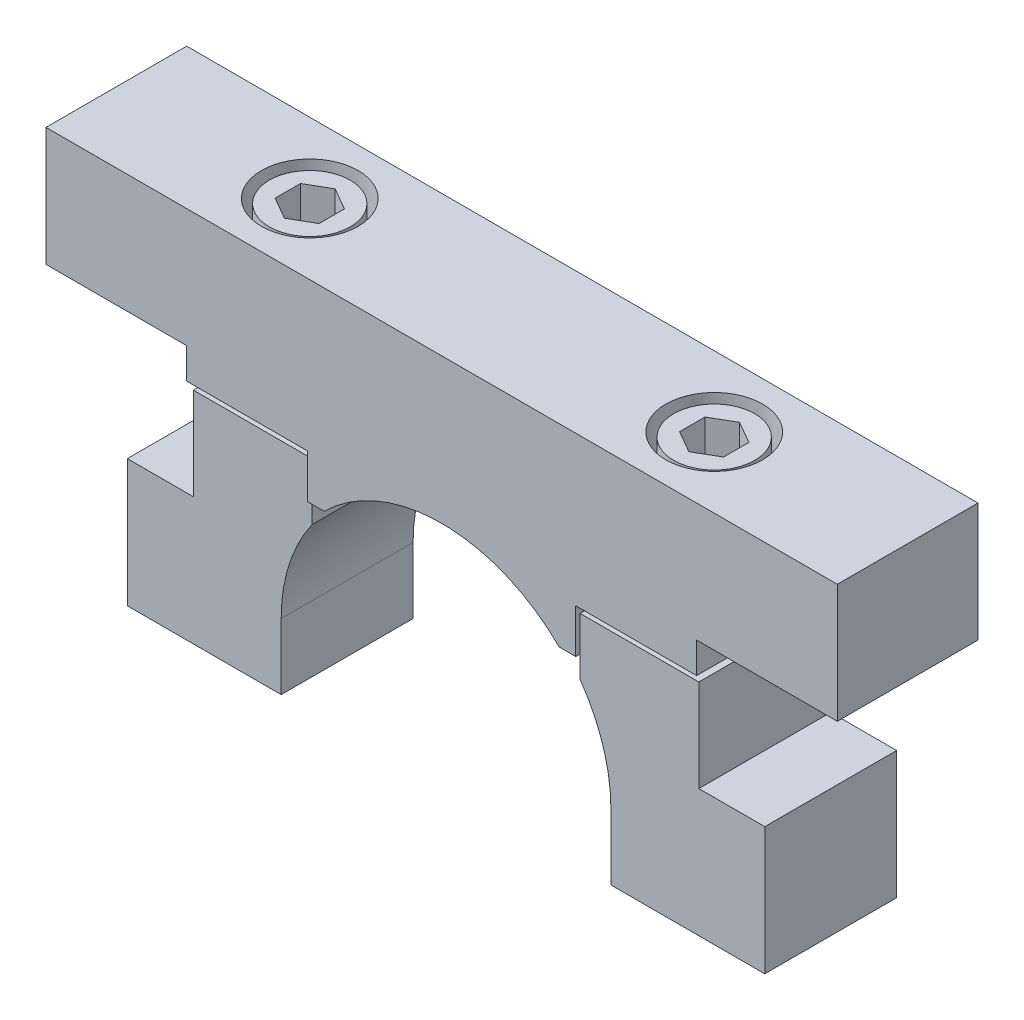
ISO-10303-21;
HEADER;
FILE_DESCRIPTION(('STEP AP214'),'2;1');
FILE_NAME('part.step','',(''),(''),'','','');
FILE_SCHEMA(('AUTOMOTIVE_DESIGN { 1 0 10303 214 1 1 1 1 }'));
ENDSEC;
DATA;
#1=APPLICATION_CONTEXT('core data for automotive mechanical design processes');
#2=APPLICATION_PROTOCOL_DEFINITION('international standard','automotive_design',2000,#1);
#3=PRODUCT_CONTEXT('',#1,'mechanical');
#4=PRODUCT('Part','Part','',(#3));
#5=PRODUCT_RELATED_PRODUCT_CATEGORY('part','',(#4));
#6=PRODUCT_DEFINITION_FORMATION('','',#4);
#7=PRODUCT_DEFINITION_CONTEXT('part definition',#1,'design');
#8=PRODUCT_DEFINITION('design','',#6,#7);
#9=PRODUCT_DEFINITION_SHAPE('','',#8);
#10=(LENGTH_UNIT() NAMED_UNIT(*) SI_UNIT(.MILLI.,.METRE.));
#11=(NAMED_UNIT(*) PLANE_ANGLE_UNIT() SI_UNIT($,.RADIAN.));
#12=(NAMED_UNIT(*) SI_UNIT($,.STERADIAN.) SOLID_ANGLE_UNIT());
#13=UNCERTAINTY_MEASURE_WITH_UNIT(LENGTH_MEASURE(1.E-05),#10,'distance_accuracy_value','');
#14=(GEOMETRIC_REPRESENTATION_CONTEXT(3) GLOBAL_UNCERTAINTY_ASSIGNED_CONTEXT((#13)) GLOBAL_UNIT_ASSIGNED_CONTEXT((#10,
#11,#12)) REPRESENTATION_CONTEXT('',''));
#15=CARTESIAN_POINT('',(0.,0.,0.));
#16=DIRECTION('',(0.,0.,1.));
#17=DIRECTION('',(1.,0.,0.));
#18=AXIS2_PLACEMENT_3D('',#15,#16,#17);
#19=CARTESIAN_POINT('',(-15.25,5.,8.));
#20=DIRECTION('',(1.,0.,0.));
#21=DIRECTION('',(0.,0.,-1.));
#22=AXIS2_PLACEMENT_3D('',#19,#20,#21);
#23=PLANE('',#22);
#24=DIRECTION('',(0.,1.,0.));
#25=VECTOR('',#24,1.);
#26=CARTESIAN_POINT('',(-15.25,4.,7.5));
#27=LINE('',#26,#25);
#28=CARTESIAN_POINT('',(-15.25,4.,7.5));
#29=VERTEX_POINT('',#28);
#30=CARTESIAN_POINT('',(-15.25,0.,7.5));
#31=VERTEX_POINT('',#30);
#32=EDGE_CURVE('E354',#29,#31,#27,.F.);
#33=ORIENTED_EDGE('',*,*,#32,.T.);
#34=DIRECTION('',(0.,0.,1.));
#35=VECTOR('',#34,1.);
#36=CARTESIAN_POINT('',(-15.25,0.,0.));
#37=LINE('',#36,#35);
#38=CARTESIAN_POINT('',(-15.25,0.,8.));
#39=VERTEX_POINT('',#38);
#40=EDGE_CURVE('E22',#31,#39,#37,.T.);
#41=ORIENTED_EDGE('',*,*,#40,.T.);
#42=DIRECTION('',(0.,-1.,0.));
#43=VECTOR('',#42,1.);
#44=CARTESIAN_POINT('',(-15.25,22.,8.));
#45=LINE('',#44,#43);
#46=CARTESIAN_POINT('',(-15.25,5.,8.));
#47=VERTEX_POINT('',#46);
#48=EDGE_CURVE('E735',#39,#47,#45,.F.);
#49=ORIENTED_EDGE('',*,*,#48,.T.);
#50=DIRECTION('',(0.,0.,-1.));
#51=VECTOR('',#50,1.);
#52=CARTESIAN_POINT('',(-15.25,5.,8.));
#53=LINE('',#52,#51);
#54=CARTESIAN_POINT('',(-15.25,5.,-8.));
#55=VERTEX_POINT('',#54);
#56=EDGE_CURVE('E571',#55,#47,#53,.F.);
#57=ORIENTED_EDGE('',*,*,#56,.F.);
#58=DIRECTION('',(0.,-1.,0.));
#59=VECTOR('',#58,1.);
#60=CARTESIAN_POINT('',(-15.25,5.,-8.));
#61=LINE('',#60,#59);
#62=CARTESIAN_POINT('',(-15.25,0.,-8.));
#63=VERTEX_POINT('',#62);
#64=EDGE_CURVE('E665',#63,#55,#61,.F.);
#65=ORIENTED_EDGE('',*,*,#64,.F.);
#66=CARTESIAN_POINT('',(-15.25,0.,-7.5));
#67=VERTEX_POINT('',#66);
#68=EDGE_CURVE('E639',#63,#67,#37,.T.);
#69=ORIENTED_EDGE('',*,*,#68,.T.);
#70=DIRECTION('',(0.,1.,0.));
#71=VECTOR('',#70,1.);
#72=CARTESIAN_POINT('',(-15.25,4.,-7.5));
#73=LINE('',#72,#71);
#74=CARTESIAN_POINT('',(-15.25,4.,-7.5));
#75=VERTEX_POINT('',#74);
#76=EDGE_CURVE('E41',#75,#67,#73,.F.);
#77=ORIENTED_EDGE('',*,*,#76,.F.);
#78=DIRECTION('',(0.,0.,-1.));
#79=VECTOR('',#78,1.);
#80=CARTESIAN_POINT('',(-15.25,4.,0.));
#81=LINE('',#80,#79);
#82=EDGE_CURVE('E36',#29,#75,#81,.T.);
#83=ORIENTED_EDGE('',*,*,#82,.F.);
#84=EDGE_LOOP('',(#33,#41,#49,#57,#65,#69,#77,#83));
#85=FACE_BOUND('',#84,.T.);
#86=ADVANCED_FACE('F18',(#85),#23,.F.);
#87=CARTESIAN_POINT('',(15.25,5.,8.));
#88=DIRECTION('',(-1.,0.,0.));
#89=DIRECTION('',(0.,0.,1.));
#90=AXIS2_PLACEMENT_3D('',#87,#88,#89);
#91=PLANE('',#90);
#92=DIRECTION('',(0.,1.,0.));
#93=VECTOR('',#92,1.);
#94=CARTESIAN_POINT('',(15.25,4.,-7.5));
#95=LINE('',#94,#93);
#96=CARTESIAN_POINT('',(15.25,4.,-7.5));
#97=VERTEX_POINT('',#96);
#98=CARTESIAN_POINT('',(15.25,0.,-7.5));
#99=VERTEX_POINT('',#98);
#100=EDGE_CURVE('E517',#97,#99,#95,.F.);
#101=ORIENTED_EDGE('',*,*,#100,.T.);
#102=DIRECTION('',(0.,0.,1.));
#103=VECTOR('',#102,1.);
#104=CARTESIAN_POINT('',(15.25,0.,8.));
#105=LINE('',#104,#103);
#106=CARTESIAN_POINT('',(15.25,0.,-8.));
#107=VERTEX_POINT('',#106);
#108=EDGE_CURVE('E644',#107,#99,#105,.T.);
#109=ORIENTED_EDGE('',*,*,#108,.F.);
#110=DIRECTION('',(0.,-1.,0.));
#111=VECTOR('',#110,1.);
#112=CARTESIAN_POINT('',(15.25,22.,-8.));
#113=LINE('',#112,#111);
#114=CARTESIAN_POINT('',(15.25,5.,-8.));
#115=VERTEX_POINT('',#114);
#116=EDGE_CURVE('E670',#107,#115,#113,.F.);
#117=ORIENTED_EDGE('',*,*,#116,.T.);
#118=DIRECTION('',(0.,0.,1.));
#119=VECTOR('',#118,1.);
#120=CARTESIAN_POINT('',(15.25,5.,0.));
#121=LINE('',#120,#119);
#122=CARTESIAN_POINT('',(15.25,5.,8.));
#123=VERTEX_POINT('',#122);
#124=EDGE_CURVE('E581',#115,#123,#121,.T.);
#125=ORIENTED_EDGE('',*,*,#124,.T.);
#126=DIRECTION('',(0.,-1.,0.));
#127=VECTOR('',#126,1.);
#128=CARTESIAN_POINT('',(15.25,5.,8.));
#129=LINE('',#128,#127);
#130=CARTESIAN_POINT('',(15.25,0.,8.));
#131=VERTEX_POINT('',#130);
#132=EDGE_CURVE('E730',#131,#123,#129,.F.);
#133=ORIENTED_EDGE('',*,*,#132,.F.);
#134=CARTESIAN_POINT('',(15.25,0.,7.5));
#135=VERTEX_POINT('',#134);
#136=EDGE_CURVE('E640',#135,#131,#105,.T.);
#137=ORIENTED_EDGE('',*,*,#136,.F.);
#138=DIRECTION('',(0.,1.,0.));
#139=VECTOR('',#138,1.);
#140=CARTESIAN_POINT('',(15.25,4.,7.5));
#141=LINE('',#140,#139);
#142=CARTESIAN_POINT('',(15.25,4.,7.5));
#143=VERTEX_POINT('',#142);
#144=EDGE_CURVE('E510',#143,#135,#141,.F.);
#145=ORIENTED_EDGE('',*,*,#144,.F.);
#146=DIRECTION('',(0.,0.,1.));
#147=VECTOR('',#146,1.);
#148=CARTESIAN_POINT('',(15.25,4.,0.));
#149=LINE('',#148,#147);
#150=EDGE_CURVE('E538',#97,#143,#149,.T.);
#151=ORIENTED_EDGE('',*,*,#150,.F.);
#152=EDGE_LOOP('',(#101,#109,#117,#125,#133,#137,#145,#151));
#153=FACE_BOUND('',#152,.T.);
#154=ADVANCED_FACE('F867',(#153),#91,.F.);
#155=CARTESIAN_POINT('',(0.,22.,0.));
#156=DIRECTION('',(0.,-1.,0.));
#157=DIRECTION('',(0.,0.,-1.));
#158=AXIS2_PLACEMENT_3D('',#155,#156,#157);
#159=PLANE('',#158);
#160=DIRECTION('',(1.,0.,0.));
#161=VECTOR('',#160,1.);
#162=CARTESIAN_POINT('',(0.,22.,8.));
#163=LINE('',#162,#161);
#164=CARTESIAN_POINT('',(45.,22.,8.));
#165=VERTEX_POINT('',#164);
#166=CARTESIAN_POINT('',(-45.,22.,8.));
#167=VERTEX_POINT('',#166);
#168=EDGE_CURVE('E28',#165,#167,#163,.F.);
#169=ORIENTED_EDGE('',*,*,#168,.F.);
#170=DIRECTION('',(0.,0.,-1.));
#171=VECTOR('',#170,1.);
#172=CARTESIAN_POINT('',(45.,22.,0.));
#173=LINE('',#172,#171);
#174=CARTESIAN_POINT('',(45.,22.,-8.));
#175=VERTEX_POINT('',#174);
#176=EDGE_CURVE('E621',#175,#165,#173,.F.);
#177=ORIENTED_EDGE('',*,*,#176,.F.);
#178=DIRECTION('',(-1.,0.,0.));
#179=VECTOR('',#178,1.);
#180=CARTESIAN_POINT('',(0.,22.,-8.));
#181=LINE('',#180,#179);
#182=CARTESIAN_POINT('',(-45.,22.,-8.));
#183=VERTEX_POINT('',#182);
#184=EDGE_CURVE('E710',#183,#175,#181,.F.);
#185=ORIENTED_EDGE('',*,*,#184,.F.);
#186=DIRECTION('',(0.,0.,-1.));
#187=VECTOR('',#186,1.);
#188=CARTESIAN_POINT('',(-45.,22.,-8.));
#189=LINE('',#188,#187);
#190=EDGE_CURVE('E625',#183,#167,#189,.F.);
#191=ORIENTED_EDGE('',*,*,#190,.T.);
#192=EDGE_LOOP('',(#169,#177,#185,#191));
#193=FACE_BOUND('',#192,.T.);
#194=CARTESIAN_POINT('',(-23.,22.,0.));
#195=DIRECTION('',(0.,-1.,0.));
#196=DIRECTION('',(0.,0.,-1.));
#197=AXIS2_PLACEMENT_3D('',#194,#195,#196);
#198=CIRCLE('',#197,5.5);
#199=CARTESIAN_POINT('',(-23.,22.,-5.5));
#200=VERTEX_POINT('',#199);
#201=EDGE_CURVE('E498',#200,#200,#198,.F.);
#202=ORIENTED_EDGE('',*,*,#201,.F.);
#203=EDGE_LOOP('',(#202));
#204=FACE_BOUND('',#203,.T.);
#205=CARTESIAN_POINT('',(23.,22.,0.));
#206=DIRECTION('',(0.,-1.,0.));
#207=DIRECTION('',(0.,0.,-1.));
#208=AXIS2_PLACEMENT_3D('',#205,#206,#207);
#209=CIRCLE('',#208,5.5);
#210=CARTESIAN_POINT('',(23.,22.,-5.5));
#211=VERTEX_POINT('',#210);
#212=EDGE_CURVE('E603',#211,#211,#209,.T.);
#213=ORIENTED_EDGE('',*,*,#212,.T.);
#214=EDGE_LOOP('',(#213));
#215=FACE_BOUND('',#214,.T.);
#216=ADVANCED_FACE('F789',(#193,#204,#215),#159,.F.);
#217=CARTESIAN_POINT('',(0.,5.,0.));
#218=DIRECTION('',(0.,1.,0.));
#219=DIRECTION('',(0.,0.,1.));
#220=AXIS2_PLACEMENT_3D('',#217,#218,#219);
#221=PLANE('',#220);
#222=DIRECTION('',(1.,0.,0.));
#223=VECTOR('',#222,1.);
#224=CARTESIAN_POINT('',(0.,5.,8.));
#225=LINE('',#224,#223);
#226=CARTESIAN_POINT('',(29.,5.,8.));
#227=VERTEX_POINT('',#226);
#228=EDGE_CURVE('E740',#123,#227,#225,.T.);
#229=ORIENTED_EDGE('',*,*,#228,.F.);
#230=ORIENTED_EDGE('',*,*,#124,.F.);
#231=DIRECTION('',(-1.,0.,0.));
#232=VECTOR('',#231,1.);
#233=CARTESIAN_POINT('',(45.,5.,-8.));
#234=LINE('',#233,#232);
#235=CARTESIAN_POINT('',(29.,5.,-8.));
#236=VERTEX_POINT('',#235);
#237=EDGE_CURVE('E680',#115,#236,#234,.F.);
#238=ORIENTED_EDGE('',*,*,#237,.T.);
#239=DIRECTION('',(0.,0.,1.));
#240=VECTOR('',#239,1.);
#241=CARTESIAN_POINT('',(29.,5.,8.));
#242=LINE('',#241,#240);
#243=EDGE_CURVE('E615',#236,#227,#242,.T.);
#244=ORIENTED_EDGE('',*,*,#243,.T.);
#245=EDGE_LOOP('',(#229,#230,#238,#244));
#246=FACE_BOUND('',#245,.T.);
#247=CARTESIAN_POINT('',(23.,5.,0.));
#248=DIRECTION('',(0.,1.,0.));
#249=DIRECTION('',(0.,0.,1.));
#250=AXIS2_PLACEMENT_3D('',#247,#248,#249);
#251=CIRCLE('',#250,3.3);
#252=CARTESIAN_POINT('',(23.,5.,3.3));
#253=VERTEX_POINT('',#252);
#254=EDGE_CURVE('E568',#253,#253,#251,.T.);
#255=ORIENTED_EDGE('',*,*,#254,.T.);
#256=EDGE_LOOP('',(#255));
#257=FACE_BOUND('',#256,.T.);
#258=ADVANCED_FACE('F891',(#246,#257),#221,.F.);
#259=CARTESIAN_POINT('',(45.,22.,8.));
#260=DIRECTION('',(0.,0.,-1.));
#261=DIRECTION('',(-1.,0.,0.));
#262=AXIS2_PLACEMENT_3D('',#259,#260,#261);
#263=PLANE('',#262);
#264=DIRECTION('',(-1.,0.,0.));
#265=VECTOR('',#264,1.);
#266=CARTESIAN_POINT('',(45.,0.,8.));
#267=LINE('',#266,#265);
#268=CARTESIAN_POINT('',(-13.3697419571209,0.,8.));
#269=VERTEX_POINT('',#268);
#270=EDGE_CURVE('E720',#269,#39,#267,.T.);
#271=ORIENTED_EDGE('',*,*,#270,.F.);
#272=CARTESIAN_POINT('',(0.,-13.5,8.));
#273=DIRECTION('',(0.,0.,-1.));
#274=DIRECTION('',(-1.,0.,0.));
#275=AXIS2_PLACEMENT_3D('',#272,#273,#274);
#276=CIRCLE('',#275,19.);
#277=CARTESIAN_POINT('',(13.3697419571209,0.,8.));
#278=VERTEX_POINT('',#277);
#279=EDGE_CURVE('E612',#278,#269,#276,.F.);
#280=ORIENTED_EDGE('',*,*,#279,.F.);
#281=DIRECTION('',(1.,0.,0.));
#282=VECTOR('',#281,1.);
#283=CARTESIAN_POINT('',(0.,0.,8.));
#284=LINE('',#283,#282);
#285=EDGE_CURVE('E725',#278,#131,#284,.T.);
#286=ORIENTED_EDGE('',*,*,#285,.T.);
#287=ORIENTED_EDGE('',*,*,#132,.T.);
#288=ORIENTED_EDGE('',*,*,#228,.T.);
#289=DIRECTION('',(0.,1.,0.));
#290=VECTOR('',#289,1.);
#291=CARTESIAN_POINT('',(29.,8.5,8.));
#292=LINE('',#291,#290);
#293=CARTESIAN_POINT('',(29.,8.5,8.));
#294=VERTEX_POINT('',#293);
#295=EDGE_CURVE('E755',#227,#294,#292,.T.);
#296=ORIENTED_EDGE('',*,*,#295,.T.);
#297=DIRECTION('',(1.,0.,0.));
#298=VECTOR('',#297,1.);
#299=CARTESIAN_POINT('',(0.,8.5,8.));
#300=LINE('',#299,#298);
#301=CARTESIAN_POINT('',(45.,8.5,8.));
#302=VERTEX_POINT('',#301);
#303=EDGE_CURVE('E760',#294,#302,#300,.T.);
#304=ORIENTED_EDGE('',*,*,#303,.T.);
#305=DIRECTION('',(0.,-1.,0.));
#306=VECTOR('',#305,1.);
#307=CARTESIAN_POINT('',(45.,22.,8.));
#308=LINE('',#307,#306);
#309=EDGE_CURVE('E770',#302,#165,#308,.F.);
#310=ORIENTED_EDGE('',*,*,#309,.T.);
#311=ORIENTED_EDGE('',*,*,#168,.T.);
#312=DIRECTION('',(0.,-1.,0.));
#313=VECTOR('',#312,1.);
#314=CARTESIAN_POINT('',(-45.,22.,8.));
#315=LINE('',#314,#313);
#316=CARTESIAN_POINT('',(-45.,8.5,8.));
#317=VERTEX_POINT('',#316);
#318=EDGE_CURVE('E11',#317,#167,#315,.F.);
#319=ORIENTED_EDGE('',*,*,#318,.F.);
#320=DIRECTION('',(-1.,0.,0.));
#321=VECTOR('',#320,1.);
#322=CARTESIAN_POINT('',(45.,8.5,8.));
#323=LINE('',#322,#321);
#324=CARTESIAN_POINT('',(-29.,8.5,8.));
#325=VERTEX_POINT('',#324);
#326=EDGE_CURVE('E765',#325,#317,#323,.T.);
#327=ORIENTED_EDGE('',*,*,#326,.F.);
#328=DIRECTION('',(0.,1.,0.));
#329=VECTOR('',#328,1.);
#330=CARTESIAN_POINT('',(-29.,22.,8.));
#331=LINE('',#330,#329);
#332=CARTESIAN_POINT('',(-29.,5.,8.));
#333=VERTEX_POINT('',#332);
#334=EDGE_CURVE('E750',#333,#325,#331,.T.);
#335=ORIENTED_EDGE('',*,*,#334,.F.);
#336=DIRECTION('',(-1.,0.,0.));
#337=VECTOR('',#336,1.);
#338=CARTESIAN_POINT('',(45.,5.,8.));
#339=LINE('',#338,#337);
#340=EDGE_CURVE('E745',#47,#333,#339,.T.);
#341=ORIENTED_EDGE('',*,*,#340,.F.);
#342=ORIENTED_EDGE('',*,*,#48,.F.);
#343=EDGE_LOOP('',(#271,#280,#286,#287,#288,#296,#304,#310,#311,#319,#327,#335,#341,#342));
#344=FACE_BOUND('',#343,.T.);
#345=ADVANCED_FACE('F785',(#344),#263,.F.);
#346=CARTESIAN_POINT('',(0.,0.,0.));
#347=DIRECTION('',(0.,-1.,0.));
#348=DIRECTION('',(0.,0.,-1.));
#349=AXIS2_PLACEMENT_3D('',#346,#347,#348);
#350=PLANE('',#349);
#351=ORIENTED_EDGE('',*,*,#270,.T.);
#352=ORIENTED_EDGE('',*,*,#40,.F.);
#353=EDGE_CURVE('E641',#67,#31,#37,.T.);
#354=ORIENTED_EDGE('',*,*,#353,.F.);
#355=ORIENTED_EDGE('',*,*,#68,.F.);
#356=DIRECTION('',(-1.,0.,0.));
#357=VECTOR('',#356,1.);
#358=CARTESIAN_POINT('',(0.,0.,-8.));
#359=LINE('',#358,#357);
#360=CARTESIAN_POINT('',(-13.3697419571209,0.,-8.));
#361=VERTEX_POINT('',#360);
#362=EDGE_CURVE('E660',#361,#63,#359,.T.);
#363=ORIENTED_EDGE('',*,*,#362,.F.);
#364=DIRECTION('',(0.,0.,-1.));
#365=VECTOR('',#364,1.);
#366=CARTESIAN_POINT('',(-13.3697419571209,0.,8.));
#367=LINE('',#366,#365);
#368=EDGE_CURVE('E569',#361,#269,#367,.F.);
#369=ORIENTED_EDGE('',*,*,#368,.T.);
#370=EDGE_LOOP('',(#351,#352,#354,#355,#363,#369));
#371=FACE_BOUND('',#370,.T.);
#372=ADVANCED_FACE('F813',(#371),#350,.T.);
#373=ORIENTED_EDGE('',*,*,#285,.F.);
#374=DIRECTION('',(0.,0.,-1.));
#375=VECTOR('',#374,1.);
#376=CARTESIAN_POINT('',(13.3697419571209,0.,8.));
#377=LINE('',#376,#375);
#378=CARTESIAN_POINT('',(13.3697419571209,0.,-8.));
#379=VERTEX_POINT('',#378);
#380=EDGE_CURVE('E566',#278,#379,#377,.T.);
#381=ORIENTED_EDGE('',*,*,#380,.T.);
#382=DIRECTION('',(1.,0.,0.));
#383=VECTOR('',#382,1.);
#384=CARTESIAN_POINT('',(45.,0.,-8.));
#385=LINE('',#384,#383);
#386=EDGE_CURVE('E655',#379,#107,#385,.T.);
#387=ORIENTED_EDGE('',*,*,#386,.T.);
#388=ORIENTED_EDGE('',*,*,#108,.T.);
#389=EDGE_CURVE('E651',#99,#135,#105,.T.);
#390=ORIENTED_EDGE('',*,*,#389,.T.);
#391=ORIENTED_EDGE('',*,*,#136,.T.);
#392=EDGE_LOOP('',(#373,#381,#387,#388,#390,#391));
#393=FACE_BOUND('',#392,.T.);
#394=ADVANCED_FACE('F898',(#393),#350,.T.);
#395=CARTESIAN_POINT('',(29.,8.5,8.));
#396=DIRECTION('',(1.,0.,0.));
#397=DIRECTION('',(0.,0.,-1.));
#398=AXIS2_PLACEMENT_3D('',#395,#396,#397);
#399=PLANE('',#398);
#400=ORIENTED_EDGE('',*,*,#295,.F.);
#401=ORIENTED_EDGE('',*,*,#243,.F.);
#402=DIRECTION('',(0.,1.,0.));
#403=VECTOR('',#402,1.);
#404=CARTESIAN_POINT('',(29.,22.,-8.));
#405=LINE('',#404,#403);
#406=CARTESIAN_POINT('',(29.,8.5,-8.));
#407=VERTEX_POINT('',#406);
#408=EDGE_CURVE('E685',#236,#407,#405,.T.);
#409=ORIENTED_EDGE('',*,*,#408,.T.);
#410=DIRECTION('',(0.,0.,-1.));
#411=VECTOR('',#410,1.);
#412=CARTESIAN_POINT('',(29.,8.5,0.));
#413=LINE('',#412,#411);
#414=EDGE_CURVE('E577',#294,#407,#413,.T.);
#415=ORIENTED_EDGE('',*,*,#414,.F.);
#416=EDGE_LOOP('',(#400,#401,#409,#415));
#417=FACE_BOUND('',#416,.T.);
#418=ADVANCED_FACE('F895',(#417),#399,.T.);
#419=CARTESIAN_POINT('',(0.,8.5,0.));
#420=DIRECTION('',(0.,-1.,0.));
#421=DIRECTION('',(0.,0.,-1.));
#422=AXIS2_PLACEMENT_3D('',#419,#420,#421);
#423=PLANE('',#422);
#424=ORIENTED_EDGE('',*,*,#303,.F.);
#425=ORIENTED_EDGE('',*,*,#414,.T.);
#426=DIRECTION('',(1.,0.,0.));
#427=VECTOR('',#426,1.);
#428=CARTESIAN_POINT('',(45.,8.5,-8.));
#429=LINE('',#428,#427);
#430=CARTESIAN_POINT('',(45.,8.5,-8.));
#431=VERTEX_POINT('',#430);
#432=EDGE_CURVE('E700',#407,#431,#429,.T.);
#433=ORIENTED_EDGE('',*,*,#432,.T.);
#434=DIRECTION('',(0.,0.,1.));
#435=VECTOR('',#434,1.);
#436=CARTESIAN_POINT('',(45.,8.5,-8.));
#437=LINE('',#436,#435);
#438=EDGE_CURVE('E617',#431,#302,#437,.T.);
#439=ORIENTED_EDGE('',*,*,#438,.T.);
#440=EDGE_LOOP('',(#424,#425,#433,#439));
#441=FACE_BOUND('',#440,.T.);
#442=ADVANCED_FACE('F885',(#441),#423,.T.);
#443=CARTESIAN_POINT('',(45.,22.,-8.));
#444=DIRECTION('',(-1.,0.,0.));
#445=DIRECTION('',(0.,0.,1.));
#446=AXIS2_PLACEMENT_3D('',#443,#444,#445);
#447=PLANE('',#446);
#448=ORIENTED_EDGE('',*,*,#309,.F.);
#449=ORIENTED_EDGE('',*,*,#438,.F.);
#450=DIRECTION('',(0.,-1.,0.));
#451=VECTOR('',#450,1.);
#452=CARTESIAN_POINT('',(45.,22.,-8.));
#453=LINE('',#452,#451);
#454=EDGE_CURVE('E715',#431,#175,#453,.F.);
#455=ORIENTED_EDGE('',*,*,#454,.T.);
#456=ORIENTED_EDGE('',*,*,#176,.T.);
#457=EDGE_LOOP('',(#448,#449,#455,#456));
#458=FACE_BOUND('',#457,.T.);
#459=ADVANCED_FACE('F888',(#458),#447,.F.);
#460=CARTESIAN_POINT('',(-45.,22.,-8.));
#461=DIRECTION('',(1.,0.,0.));
#462=DIRECTION('',(0.,0.,-1.));
#463=AXIS2_PLACEMENT_3D('',#460,#461,#462);
#464=PLANE('',#463);
#465=ORIENTED_EDGE('',*,*,#318,.T.);
#466=ORIENTED_EDGE('',*,*,#190,.F.);
#467=DIRECTION('',(0.,-1.,0.));
#468=VECTOR('',#467,1.);
#469=CARTESIAN_POINT('',(-45.,22.,-8.));
#470=LINE('',#469,#468);
#471=CARTESIAN_POINT('',(-45.,8.5,-8.));
#472=VERTEX_POINT('',#471);
#473=EDGE_CURVE('E705',#472,#183,#470,.F.);
#474=ORIENTED_EDGE('',*,*,#473,.F.);
#475=DIRECTION('',(0.,0.,1.));
#476=VECTOR('',#475,1.);
#477=CARTESIAN_POINT('',(-45.,8.5,0.));
#478=LINE('',#477,#476);
#479=EDGE_CURVE('E629',#472,#317,#478,.T.);
#480=ORIENTED_EDGE('',*,*,#479,.T.);
#481=EDGE_LOOP('',(#465,#466,#474,#480));
#482=FACE_BOUND('',#481,.T.);
#483=ADVANCED_FACE('F794',(#482),#464,.F.);
#484=ORIENTED_EDGE('',*,*,#326,.T.);
#485=ORIENTED_EDGE('',*,*,#479,.F.);
#486=DIRECTION('',(-1.,0.,0.));
#487=VECTOR('',#486,1.);
#488=CARTESIAN_POINT('',(0.,8.5,-8.));
#489=LINE('',#488,#487);
#490=CARTESIAN_POINT('',(-29.,8.5,-8.));
#491=VERTEX_POINT('',#490);
#492=EDGE_CURVE('E695',#491,#472,#489,.T.);
#493=ORIENTED_EDGE('',*,*,#492,.F.);
#494=DIRECTION('',(0.,0.,1.));
#495=VECTOR('',#494,1.);
#496=CARTESIAN_POINT('',(-29.,8.5,8.));
#497=LINE('',#496,#495);
#498=EDGE_CURVE('E573',#325,#491,#497,.F.);
#499=ORIENTED_EDGE('',*,*,#498,.F.);
#500=EDGE_LOOP('',(#484,#485,#493,#499));
#501=FACE_BOUND('',#500,.T.);
#502=ADVANCED_FACE('F797',(#501),#423,.T.);
#503=CARTESIAN_POINT('',(-29.,8.5,8.));
#504=DIRECTION('',(-1.,0.,0.));
#505=DIRECTION('',(0.,0.,1.));
#506=AXIS2_PLACEMENT_3D('',#503,#504,#505);
#507=PLANE('',#506);
#508=ORIENTED_EDGE('',*,*,#334,.T.);
#509=ORIENTED_EDGE('',*,*,#498,.T.);
#510=DIRECTION('',(0.,1.,0.));
#511=VECTOR('',#510,1.);
#512=CARTESIAN_POINT('',(-29.,8.5,-8.));
#513=LINE('',#512,#511);
#514=CARTESIAN_POINT('',(-29.,5.,-8.));
#515=VERTEX_POINT('',#514);
#516=EDGE_CURVE('E690',#515,#491,#513,.T.);
#517=ORIENTED_EDGE('',*,*,#516,.F.);
#518=DIRECTION('',(0.,0.,1.));
#519=VECTOR('',#518,1.);
#520=CARTESIAN_POINT('',(-29.,5.,8.));
#521=LINE('',#520,#519);
#522=EDGE_CURVE('E633',#333,#515,#521,.F.);
#523=ORIENTED_EDGE('',*,*,#522,.F.);
#524=EDGE_LOOP('',(#508,#509,#517,#523));
#525=FACE_BOUND('',#524,.T.);
#526=ADVANCED_FACE('F801',(#525),#507,.T.);
#527=CARTESIAN_POINT('',(0.,5.,0.));
#528=DIRECTION('',(0.,-1.,0.));
#529=DIRECTION('',(0.,0.,-1.));
#530=AXIS2_PLACEMENT_3D('',#527,#528,#529);
#531=PLANE('',#530);
#532=ORIENTED_EDGE('',*,*,#340,.T.);
#533=ORIENTED_EDGE('',*,*,#522,.T.);
#534=DIRECTION('',(1.,0.,0.));
#535=VECTOR('',#534,1.);
#536=CARTESIAN_POINT('',(0.,5.,-8.));
#537=LINE('',#536,#535);
#538=EDGE_CURVE('E675',#55,#515,#537,.F.);
#539=ORIENTED_EDGE('',*,*,#538,.F.);
#540=ORIENTED_EDGE('',*,*,#56,.T.);
#541=EDGE_LOOP('',(#532,#533,#539,#540));
#542=FACE_BOUND('',#541,.T.);
#543=CARTESIAN_POINT('',(-23.,5.,0.));
#544=DIRECTION('',(0.,-1.,0.));
#545=DIRECTION('',(0.,0.,-1.));
#546=AXIS2_PLACEMENT_3D('',#543,#544,#545);
#547=CIRCLE('',#546,3.3);
#548=CARTESIAN_POINT('',(-23.,5.,-3.3));
#549=VERTEX_POINT('',#548);
#550=EDGE_CURVE('E606',#549,#549,#547,.T.);
#551=ORIENTED_EDGE('',*,*,#550,.F.);
#552=EDGE_LOOP('',(#551));
#553=FACE_BOUND('',#552,.T.);
#554=ADVANCED_FACE('F805',(#542,#553),#531,.T.);
#555=CARTESIAN_POINT('',(0.,-13.5,8.));
#556=DIRECTION('',(0.,0.,-1.));
#557=DIRECTION('',(-1.,0.,0.));
#558=AXIS2_PLACEMENT_3D('',#555,#556,#557);
#559=CYLINDRICAL_SURFACE('',#558,19.);
#560=ORIENTED_EDGE('',*,*,#380,.F.);
#561=ORIENTED_EDGE('',*,*,#279,.T.);
#562=ORIENTED_EDGE('',*,*,#368,.F.);
#563=CARTESIAN_POINT('',(0.,-13.5,-8.));
#564=DIRECTION('',(0.,0.,1.));
#565=DIRECTION('',(1.,0.,0.));
#566=AXIS2_PLACEMENT_3D('',#563,#564,#565);
#567=CIRCLE('',#566,19.);
#568=EDGE_CURVE('E609',#361,#379,#567,.F.);
#569=ORIENTED_EDGE('',*,*,#568,.T.);
#570=EDGE_LOOP('',(#560,#561,#562,#569));
#571=FACE_BOUND('',#570,.T.);
#572=ADVANCED_FACE('F877',(#571),#559,.F.);
#573=CARTESIAN_POINT('',(45.,22.,-8.));
#574=DIRECTION('',(0.,0.,1.));
#575=DIRECTION('',(1.,0.,0.));
#576=AXIS2_PLACEMENT_3D('',#573,#574,#575);
#577=PLANE('',#576);
#578=ORIENTED_EDGE('',*,*,#386,.F.);
#579=ORIENTED_EDGE('',*,*,#568,.F.);
#580=ORIENTED_EDGE('',*,*,#362,.T.);
#581=ORIENTED_EDGE('',*,*,#64,.T.);
#582=ORIENTED_EDGE('',*,*,#538,.T.);
#583=ORIENTED_EDGE('',*,*,#516,.T.);
#584=ORIENTED_EDGE('',*,*,#492,.T.);
#585=ORIENTED_EDGE('',*,*,#473,.T.);
#586=ORIENTED_EDGE('',*,*,#184,.T.);
#587=ORIENTED_EDGE('',*,*,#454,.F.);
#588=ORIENTED_EDGE('',*,*,#432,.F.);
#589=ORIENTED_EDGE('',*,*,#408,.F.);
#590=ORIENTED_EDGE('',*,*,#237,.F.);
#591=ORIENTED_EDGE('',*,*,#116,.F.);
#592=EDGE_LOOP('',(#578,#579,#580,#581,#582,#583,#584,#585,#586,#587,#588,#589,#590,#591));
#593=FACE_BOUND('',#592,.T.);
#594=ADVANCED_FACE('F902',(#593),#577,.F.);
#595=CARTESIAN_POINT('',(23.,22.,0.));
#596=DIRECTION('',(0.,1.,0.));
#597=DIRECTION('',(0.,0.,1.));
#598=AXIS2_PLACEMENT_3D('',#595,#596,#597);
#599=CYLINDRICAL_SURFACE('',#598,5.5);
#600=CARTESIAN_POINT('',(23.,15.5,0.));
#601=DIRECTION('',(0.,1.,0.));
#602=DIRECTION('',(0.,0.,1.));
#603=AXIS2_PLACEMENT_3D('',#600,#601,#602);
#604=CIRCLE('',#603,5.5);
#605=CARTESIAN_POINT('',(23.,15.5,5.5));
#606=VERTEX_POINT('',#605);
#607=EDGE_CURVE('E590',#606,#606,#604,.T.);
#608=ORIENTED_EDGE('',*,*,#607,.F.);
#609=EDGE_LOOP('',(#608));
#610=FACE_BOUND('',#609,.T.);
#611=ORIENTED_EDGE('',*,*,#212,.F.);
#612=EDGE_LOOP('',(#611));
#613=FACE_BOUND('',#612,.T.);
#614=ADVANCED_FACE('F908',(#610,#613),#599,.F.);
#615=CARTESIAN_POINT('',(28.5,15.5,0.));
#616=DIRECTION('',(0.,-1.,0.));
#617=DIRECTION('',(0.,0.,-1.));
#618=AXIS2_PLACEMENT_3D('',#615,#616,#617);
#619=PLANE('',#618);
#620=CARTESIAN_POINT('',(23.,15.5,0.));
#621=DIRECTION('',(0.,1.,0.));
#622=DIRECTION('',(-1.,0.,0.));
#623=AXIS2_PLACEMENT_3D('',#620,#621,#622);
#624=CIRCLE('',#623,4.6);
#625=CARTESIAN_POINT('',(18.4,15.5,0.));
#626=VERTEX_POINT('',#625);
#627=EDGE_CURVE('E488',#626,#626,#624,.T.);
#628=ORIENTED_EDGE('',*,*,#627,.F.);
#629=EDGE_LOOP('',(#628));
#630=FACE_BOUND('',#629,.T.);
#631=ORIENTED_EDGE('',*,*,#607,.T.);
#632=EDGE_LOOP('',(#631));
#633=FACE_BOUND('',#632,.T.);
#634=ADVANCED_FACE('F914',(#630,#633),#619,.F.);
#635=CARTESIAN_POINT('',(23.,22.,0.));
#636=DIRECTION('',(0.,1.,0.));
#637=DIRECTION('',(0.,0.,1.));
#638=AXIS2_PLACEMENT_3D('',#635,#636,#637);
#639=CYLINDRICAL_SURFACE('',#638,3.3);
#640=CARTESIAN_POINT('',(23.,15.5,0.));
#641=DIRECTION('',(0.,1.,0.));
#642=DIRECTION('',(0.,0.,1.));
#643=AXIS2_PLACEMENT_3D('',#640,#641,#642);
#644=CIRCLE('',#643,3.3);
#645=CARTESIAN_POINT('',(23.,15.5,3.3));
#646=VERTEX_POINT('',#645);
#647=EDGE_CURVE('E596',#646,#646,#644,.F.);
#648=ORIENTED_EDGE('',*,*,#647,.F.);
#649=EDGE_LOOP('',(#648));
#650=FACE_BOUND('',#649,.T.);
#651=ORIENTED_EDGE('',*,*,#254,.F.);
#652=EDGE_LOOP('',(#651));
#653=FACE_BOUND('',#652,.T.);
#654=ADVANCED_FACE('F917',(#650,#653),#639,.F.);
#655=CARTESIAN_POINT('',(-23.,22.,0.));
#656=DIRECTION('',(0.,1.,0.));
#657=DIRECTION('',(0.,0.,1.));
#658=AXIS2_PLACEMENT_3D('',#655,#656,#657);
#659=CYLINDRICAL_SURFACE('',#658,3.3);
#660=CARTESIAN_POINT('',(-23.,15.5,0.));
#661=DIRECTION('',(0.,1.,0.));
#662=DIRECTION('',(0.,0.,1.));
#663=AXIS2_PLACEMENT_3D('',#660,#661,#662);
#664=CIRCLE('',#663,3.3);
#665=CARTESIAN_POINT('',(-23.,15.5,3.3));
#666=VERTEX_POINT('',#665);
#667=EDGE_CURVE('E585',#666,#666,#664,.F.);
#668=ORIENTED_EDGE('',*,*,#667,.F.);
#669=EDGE_LOOP('',(#668));
#670=FACE_BOUND('',#669,.T.);
#671=ORIENTED_EDGE('',*,*,#550,.T.);
#672=EDGE_LOOP('',(#671));
#673=FACE_BOUND('',#672,.T.);
#674=ADVANCED_FACE('F912',(#670,#673),#659,.F.);
#675=CARTESIAN_POINT('',(-17.5,15.5,0.));
#676=DIRECTION('',(0.,-1.,0.));
#677=DIRECTION('',(0.,0.,-1.));
#678=AXIS2_PLACEMENT_3D('',#675,#676,#677);
#679=PLANE('',#678);
#680=CARTESIAN_POINT('',(-23.,15.5,0.));
#681=DIRECTION('',(0.,1.,0.));
#682=DIRECTION('',(-1.,0.,0.));
#683=AXIS2_PLACEMENT_3D('',#680,#681,#682);
#684=CIRCLE('',#683,4.6);
#685=CARTESIAN_POINT('',(-27.6,15.5,0.));
#686=VERTEX_POINT('',#685);
#687=EDGE_CURVE('E381',#686,#686,#684,.T.);
#688=ORIENTED_EDGE('',*,*,#687,.F.);
#689=EDGE_LOOP('',(#688));
#690=FACE_BOUND('',#689,.T.);
#691=CARTESIAN_POINT('',(-23.,15.5,0.));
#692=DIRECTION('',(0.,1.,0.));
#693=DIRECTION('',(0.,0.,1.));
#694=AXIS2_PLACEMENT_3D('',#691,#692,#693);
#695=CIRCLE('',#694,5.5);
#696=CARTESIAN_POINT('',(-23.,15.5,5.5));
#697=VERTEX_POINT('',#696);
#698=EDGE_CURVE('E593',#697,#697,#695,.T.);
#699=ORIENTED_EDGE('',*,*,#698,.T.);
#700=EDGE_LOOP('',(#699));
#701=FACE_BOUND('',#700,.T.);
#702=ADVANCED_FACE('F909',(#690,#701),#679,.F.);
#703=CARTESIAN_POINT('',(-23.,22.,0.));
#704=DIRECTION('',(0.,1.,0.));
#705=DIRECTION('',(0.,0.,1.));
#706=AXIS2_PLACEMENT_3D('',#703,#704,#705);
#707=CYLINDRICAL_SURFACE('',#706,5.5);
#708=ORIENTED_EDGE('',*,*,#698,.F.);
#709=EDGE_LOOP('',(#708));
#710=FACE_BOUND('',#709,.T.);
#711=ORIENTED_EDGE('',*,*,#201,.T.);
#712=EDGE_LOOP('',(#711));
#713=FACE_BOUND('',#712,.T.);
#714=ADVANCED_FACE('F20',(#710,#713),#707,.F.);
#715=CARTESIAN_POINT('',(-0.250000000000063,-13.5,7.5));
#716=DIRECTION('',(0.,0.,-1.));
#717=DIRECTION('',(-1.,0.,0.));
#718=AXIS2_PLACEMENT_3D('',#715,#716,#717);
#719=CYLINDRICAL_SURFACE('',#718,19.);
#720=DIRECTION('',(0.,0.,-1.));
#721=VECTOR('',#720,1.);
#722=CARTESIAN_POINT('',(18.75,-13.5,7.5));
#723=LINE('',#722,#721);
#724=CARTESIAN_POINT('',(18.75,-13.5,-7.5));
#725=VERTEX_POINT('',#724);
#726=CARTESIAN_POINT('',(18.75,-13.5,7.5));
#727=VERTEX_POINT('',#726);
#728=EDGE_CURVE('E499',#725,#727,#723,.F.);
#729=ORIENTED_EDGE('',*,*,#728,.T.);
#730=CARTESIAN_POINT('',(-0.250000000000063,-13.5,7.5));
#731=DIRECTION('',(0.,0.,-1.));
#732=DIRECTION('',(-1.,0.,0.));
#733=AXIS2_PLACEMENT_3D('',#730,#731,#732);
#734=CIRCLE('',#733,19.);
#735=CARTESIAN_POINT('',(15.25,-2.51136951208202,7.5));
#736=VERTEX_POINT('',#735);
#737=EDGE_CURVE('E513',#727,#736,#734,.F.);
#738=ORIENTED_EDGE('',*,*,#737,.T.);
#739=DIRECTION('',(0.,0.,-1.));
#740=VECTOR('',#739,1.);
#741=CARTESIAN_POINT('',(15.25,-2.51136951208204,7.5));
#742=LINE('',#741,#740);
#743=CARTESIAN_POINT('',(15.25,-2.51136951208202,-7.5));
#744=VERTEX_POINT('',#743);
#745=EDGE_CURVE('E505',#736,#744,#742,.T.);
#746=ORIENTED_EDGE('',*,*,#745,.T.);
#747=CARTESIAN_POINT('',(-0.250000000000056,-13.5,-7.5));
#748=DIRECTION('',(0.,0.,1.));
#749=DIRECTION('',(1.,0.,0.));
#750=AXIS2_PLACEMENT_3D('',#747,#748,#749);
#751=CIRCLE('',#750,19.);
#752=EDGE_CURVE('E521',#744,#725,#751,.F.);
#753=ORIENTED_EDGE('',*,*,#752,.T.);
#754=EDGE_LOOP('',(#729,#738,#746,#753));
#755=FACE_BOUND('',#754,.T.);
#756=ADVANCED_FACE('F1022',(#755),#719,.F.);
#757=CARTESIAN_POINT('',(28.75,-6.5,7.5));
#758=DIRECTION('',(-1.,0.,0.));
#759=DIRECTION('',(0.,0.,1.));
#760=AXIS2_PLACEMENT_3D('',#757,#758,#759);
#761=PLANE('',#760);
#762=DIRECTION('',(0.,0.,-1.));
#763=VECTOR('',#762,1.);
#764=CARTESIAN_POINT('',(28.75,4.,0.));
#765=LINE('',#764,#763);
#766=CARTESIAN_POINT('',(28.75,4.,7.5));
#767=VERTEX_POINT('',#766);
#768=CARTESIAN_POINT('',(28.75,4.,-7.5));
#769=VERTEX_POINT('',#768);
#770=EDGE_CURVE('E544',#767,#769,#765,.T.);
#771=ORIENTED_EDGE('',*,*,#770,.F.);
#772=DIRECTION('',(0.,-1.,0.));
#773=VECTOR('',#772,1.);
#774=CARTESIAN_POINT('',(28.75,-6.5,7.5));
#775=LINE('',#774,#773);
#776=CARTESIAN_POINT('',(28.75,-6.5,7.5));
#777=VERTEX_POINT('',#776);
#778=EDGE_CURVE('E532',#777,#767,#775,.F.);
#779=ORIENTED_EDGE('',*,*,#778,.F.);
#780=DIRECTION('',(0.,0.,-1.));
#781=VECTOR('',#780,1.);
#782=CARTESIAN_POINT('',(28.75,-6.5,7.5));
#783=LINE('',#782,#781);
#784=CARTESIAN_POINT('',(28.75,-6.5,-7.5));
#785=VERTEX_POINT('',#784);
#786=EDGE_CURVE('E503',#777,#785,#783,.T.);
#787=ORIENTED_EDGE('',*,*,#786,.T.);
#788=DIRECTION('',(0.,-1.,0.));
#789=VECTOR('',#788,1.);
#790=CARTESIAN_POINT('',(28.75,4.,-7.5));
#791=LINE('',#790,#789);
#792=EDGE_CURVE('E524',#785,#769,#791,.F.);
#793=ORIENTED_EDGE('',*,*,#792,.T.);
#794=EDGE_LOOP('',(#771,#779,#787,#793));
#795=FACE_BOUND('',#794,.T.);
#796=ADVANCED_FACE('F1020',(#795),#761,.F.);
#797=CARTESIAN_POINT('',(28.75,-6.5,7.5));
#798=DIRECTION('',(0.,-1.,0.));
#799=DIRECTION('',(-1.,0.,0.));
#800=AXIS2_PLACEMENT_3D('',#797,#798,#799);
#801=PLANE('',#800);
#802=DIRECTION('',(-1.,0.,0.));
#803=VECTOR('',#802,1.);
#804=CARTESIAN_POINT('',(28.75,-6.5,-7.5));
#805=LINE('',#804,#803);
#806=CARTESIAN_POINT('',(36.25,-6.5,-7.5));
#807=VERTEX_POINT('',#806);
#808=EDGE_CURVE('E549',#785,#807,#805,.F.);
#809=ORIENTED_EDGE('',*,*,#808,.F.);
#810=ORIENTED_EDGE('',*,*,#786,.F.);
#811=DIRECTION('',(-1.,0.,0.));
#812=VECTOR('',#811,1.);
#813=CARTESIAN_POINT('',(15.25,-6.5,7.5));
#814=LINE('',#813,#812);
#815=CARTESIAN_POINT('',(36.25,-6.5,7.5));
#816=VERTEX_POINT('',#815);
#817=EDGE_CURVE('E552',#777,#816,#814,.F.);
#818=ORIENTED_EDGE('',*,*,#817,.T.);
#819=DIRECTION('',(0.,0.,-1.));
#820=VECTOR('',#819,1.);
#821=CARTESIAN_POINT('',(36.25,-6.5,7.5));
#822=LINE('',#821,#820);
#823=EDGE_CURVE('E553',#807,#816,#822,.F.);
#824=ORIENTED_EDGE('',*,*,#823,.F.);
#825=EDGE_LOOP('',(#809,#810,#818,#824));
#826=FACE_BOUND('',#825,.T.);
#827=ADVANCED_FACE('F1016',(#826),#801,.F.);
#828=CARTESIAN_POINT('',(36.25,4.,7.5));
#829=DIRECTION('',(-1.,0.,0.));
#830=DIRECTION('',(0.,0.,1.));
#831=AXIS2_PLACEMENT_3D('',#828,#829,#830);
#832=PLANE('',#831);
#833=DIRECTION('',(0.,1.,0.));
#834=VECTOR('',#833,1.);
#835=CARTESIAN_POINT('',(36.25,4.,7.5));
#836=LINE('',#835,#834);
#837=CARTESIAN_POINT('',(36.25,-21.,7.5));
#838=VERTEX_POINT('',#837);
#839=EDGE_CURVE('E529',#816,#838,#836,.F.);
#840=ORIENTED_EDGE('',*,*,#839,.T.);
#841=DIRECTION('',(0.,0.,-1.));
#842=VECTOR('',#841,1.);
#843=CARTESIAN_POINT('',(36.25,-21.,0.));
#844=LINE('',#843,#842);
#845=CARTESIAN_POINT('',(36.25,-21.,-7.5));
#846=VERTEX_POINT('',#845);
#847=EDGE_CURVE('E480',#838,#846,#844,.T.);
#848=ORIENTED_EDGE('',*,*,#847,.T.);
#849=DIRECTION('',(0.,1.,0.));
#850=VECTOR('',#849,1.);
#851=CARTESIAN_POINT('',(36.25,4.,-7.5));
#852=LINE('',#851,#850);
#853=EDGE_CURVE('E535',#807,#846,#852,.F.);
#854=ORIENTED_EDGE('',*,*,#853,.F.);
#855=ORIENTED_EDGE('',*,*,#823,.T.);
#856=EDGE_LOOP('',(#840,#848,#854,#855));
#857=FACE_BOUND('',#856,.T.);
#858=ADVANCED_FACE('F1019',(#857),#832,.F.);
#859=CARTESIAN_POINT('',(25.75,-21.,0.));
#860=DIRECTION('',(0.,-1.,0.));
#861=DIRECTION('',(0.,0.,1.));
#862=AXIS2_PLACEMENT_3D('',#859,#860,#861);
#863=PLANE('',#862);
#864=ORIENTED_EDGE('',*,*,#847,.F.);
#865=DIRECTION('',(1.,0.,0.));
#866=VECTOR('',#865,1.);
#867=CARTESIAN_POINT('',(25.75,-21.,7.5));
#868=LINE('',#867,#866);
#869=CARTESIAN_POINT('',(18.75,-21.,7.5));
#870=VERTEX_POINT('',#869);
#871=EDGE_CURVE('E556',#870,#838,#868,.T.);
#872=ORIENTED_EDGE('',*,*,#871,.F.);
#873=DIRECTION('',(0.,0.,1.));
#874=VECTOR('',#873,1.);
#875=CARTESIAN_POINT('',(18.75,-21.,0.));
#876=LINE('',#875,#874);
#877=CARTESIAN_POINT('',(18.75,-21.,-7.5));
#878=VERTEX_POINT('',#877);
#879=EDGE_CURVE('E560',#878,#870,#876,.T.);
#880=ORIENTED_EDGE('',*,*,#879,.F.);
#881=DIRECTION('',(-1.,0.,0.));
#882=VECTOR('',#881,1.);
#883=CARTESIAN_POINT('',(25.75,-21.,-7.5));
#884=LINE('',#883,#882);
#885=EDGE_CURVE('E562',#846,#878,#884,.T.);
#886=ORIENTED_EDGE('',*,*,#885,.F.);
#887=EDGE_LOOP('',(#864,#872,#880,#886));
#888=FACE_BOUND('',#887,.T.);
#889=ADVANCED_FACE('F1043',(#888),#863,.T.);
#890=CARTESIAN_POINT('',(18.75,-13.5,7.5));
#891=DIRECTION('',(1.,0.,0.));
#892=DIRECTION('',(0.,-1.,0.));
#893=AXIS2_PLACEMENT_3D('',#890,#891,#892);
#894=PLANE('',#893);
#895=DIRECTION('',(0.,-1.,0.));
#896=VECTOR('',#895,1.);
#897=CARTESIAN_POINT('',(18.75,-13.5,-7.5));
#898=LINE('',#897,#896);
#899=EDGE_CURVE('E519',#878,#725,#898,.F.);
#900=ORIENTED_EDGE('',*,*,#899,.F.);
#901=ORIENTED_EDGE('',*,*,#879,.T.);
#902=DIRECTION('',(0.,-1.,0.));
#903=VECTOR('',#902,1.);
#904=CARTESIAN_POINT('',(18.75,4.,7.5));
#905=LINE('',#904,#903);
#906=EDGE_CURVE('E502',#870,#727,#905,.F.);
#907=ORIENTED_EDGE('',*,*,#906,.T.);
#908=ORIENTED_EDGE('',*,*,#728,.F.);
#909=EDGE_LOOP('',(#900,#901,#907,#908));
#910=FACE_BOUND('',#909,.T.);
#911=ADVANCED_FACE('F1046',(#910),#894,.F.);
#912=CARTESIAN_POINT('',(15.25,4.,7.5));
#913=DIRECTION('',(0.,0.,-1.));
#914=DIRECTION('',(-1.,0.,0.));
#915=AXIS2_PLACEMENT_3D('',#912,#913,#914);
#916=PLANE('',#915);
#917=ORIENTED_EDGE('',*,*,#906,.F.);
#918=ORIENTED_EDGE('',*,*,#871,.T.);
#919=ORIENTED_EDGE('',*,*,#839,.F.);
#920=ORIENTED_EDGE('',*,*,#817,.F.);
#921=ORIENTED_EDGE('',*,*,#778,.T.);
#922=DIRECTION('',(1.,0.,0.));
#923=VECTOR('',#922,1.);
#924=CARTESIAN_POINT('',(25.75,4.,7.5));
#925=LINE('',#924,#923);
#926=EDGE_CURVE('E541',#143,#767,#925,.T.);
#927=ORIENTED_EDGE('',*,*,#926,.F.);
#928=ORIENTED_EDGE('',*,*,#144,.T.);
#929=EDGE_CURVE('E509',#135,#736,#141,.F.);
#930=ORIENTED_EDGE('',*,*,#929,.T.);
#931=ORIENTED_EDGE('',*,*,#737,.F.);
#932=EDGE_LOOP('',(#917,#918,#919,#920,#921,#927,#928,#930,#931));
#933=FACE_BOUND('',#932,.T.);
#934=ADVANCED_FACE('F1051',(#933),#916,.F.);
#935=CARTESIAN_POINT('',(15.25,4.,-7.5));
#936=DIRECTION('',(0.,0.,1.));
#937=DIRECTION('',(1.,0.,0.));
#938=AXIS2_PLACEMENT_3D('',#935,#936,#937);
#939=PLANE('',#938);
#940=ORIENTED_EDGE('',*,*,#853,.T.);
#941=ORIENTED_EDGE('',*,*,#885,.T.);
#942=ORIENTED_EDGE('',*,*,#899,.T.);
#943=ORIENTED_EDGE('',*,*,#752,.F.);
#944=EDGE_CURVE('E516',#99,#744,#95,.F.);
#945=ORIENTED_EDGE('',*,*,#944,.F.);
#946=ORIENTED_EDGE('',*,*,#100,.F.);
#947=DIRECTION('',(-1.,0.,0.));
#948=VECTOR('',#947,1.);
#949=CARTESIAN_POINT('',(25.75,4.,-7.5));
#950=LINE('',#949,#948);
#951=EDGE_CURVE('E546',#769,#97,#950,.T.);
#952=ORIENTED_EDGE('',*,*,#951,.F.);
#953=ORIENTED_EDGE('',*,*,#792,.F.);
#954=ORIENTED_EDGE('',*,*,#808,.T.);
#955=EDGE_LOOP('',(#940,#941,#942,#943,#945,#946,#952,#953,#954));
#956=FACE_BOUND('',#955,.T.);
#957=ADVANCED_FACE('F1035',(#956),#939,.F.);
#958=CARTESIAN_POINT('',(25.75,4.,0.));
#959=DIRECTION('',(0.,-1.,0.));
#960=DIRECTION('',(0.,0.,1.));
#961=AXIS2_PLACEMENT_3D('',#958,#959,#960);
#962=PLANE('',#961);
#963=CARTESIAN_POINT('',(23.,4.,0.));
#964=DIRECTION('',(0.,-1.,0.));
#965=DIRECTION('',(0.,0.,-1.));
#966=AXIS2_PLACEMENT_3D('',#963,#964,#965);
#967=CIRCLE('',#966,3.);
#968=CARTESIAN_POINT('',(23.,4.,-3.));
#969=VERTEX_POINT('',#968);
#970=EDGE_CURVE('E484',#969,#969,#967,.F.);
#971=ORIENTED_EDGE('',*,*,#970,.F.);
#972=EDGE_LOOP('',(#971));
#973=FACE_BOUND('',#972,.T.);
#974=ORIENTED_EDGE('',*,*,#770,.T.);
#975=ORIENTED_EDGE('',*,*,#951,.T.);
#976=ORIENTED_EDGE('',*,*,#150,.T.);
#977=ORIENTED_EDGE('',*,*,#926,.T.);
#978=EDGE_LOOP('',(#974,#975,#976,#977));
#979=FACE_BOUND('',#978,.T.);
#980=ADVANCED_FACE('F1032',(#973,#979),#962,.F.);
#981=CARTESIAN_POINT('',(15.25,4.,7.5));
#982=DIRECTION('',(1.,0.,0.));
#983=DIRECTION('',(0.,0.,-1.));
#984=AXIS2_PLACEMENT_3D('',#981,#982,#983);
#985=PLANE('',#984);
#986=ORIENTED_EDGE('',*,*,#389,.F.);
#987=ORIENTED_EDGE('',*,*,#944,.T.);
#988=ORIENTED_EDGE('',*,*,#745,.F.);
#989=ORIENTED_EDGE('',*,*,#929,.F.);
#990=EDGE_LOOP('',(#986,#987,#988,#989));
#991=FACE_BOUND('',#990,.T.);
#992=ADVANCED_FACE('F963',(#991),#985,.F.);
#993=CARTESIAN_POINT('',(23.,15.5,0.));
#994=DIRECTION('',(0.,1.,0.));
#995=DIRECTION('',(0.,0.,1.));
#996=AXIS2_PLACEMENT_3D('',#993,#994,#995);
#997=CYLINDRICAL_SURFACE('',#996,3.);
#998=CARTESIAN_POINT('',(23.,15.5,0.));
#999=DIRECTION('',(0.,1.,0.));
#1000=DIRECTION('',(0.,0.,1.));
#1001=AXIS2_PLACEMENT_3D('',#998,#999,#1000);
#1002=CIRCLE('',#1001,3.);
#1003=CARTESIAN_POINT('',(23.,15.5,3.));
#1004=VERTEX_POINT('',#1003);
#1005=EDGE_CURVE('E481',#1004,#1004,#1002,.F.);
#1006=ORIENTED_EDGE('',*,*,#1005,.T.);
#1007=EDGE_LOOP('',(#1006));
#1008=FACE_BOUND('',#1007,.T.);
#1009=ORIENTED_EDGE('',*,*,#970,.T.);
#1010=EDGE_LOOP('',(#1009));
#1011=FACE_BOUND('',#1010,.T.);
#1012=ADVANCED_FACE('F959',(#1008,#1011),#997,.T.);
#1013=CARTESIAN_POINT('',(26.,15.5,0.));
#1014=DIRECTION('',(0.,1.,0.));
#1015=DIRECTION('',(0.,0.,1.));
#1016=AXIS2_PLACEMENT_3D('',#1013,#1014,#1015);
#1017=PLANE('',#1016);
#1018=ORIENTED_EDGE('',*,*,#1005,.F.);
#1019=EDGE_LOOP('',(#1018));
#1020=FACE_BOUND('',#1019,.T.);
#1021=ORIENTED_EDGE('',*,*,#647,.T.);
#1022=EDGE_LOOP('',(#1021));
#1023=FACE_BOUND('',#1022,.T.);
#1024=ADVANCED_FACE('F962',(#1020,#1023),#1017,.F.);
#1025=CARTESIAN_POINT('',(23.,11.5,0.));
#1026=DIRECTION('',(0.,1.,0.));
#1027=DIRECTION('',(-1.,0.,0.));
#1028=AXIS2_PLACEMENT_3D('',#1025,#1026,#1027);
#1029=CYLINDRICAL_SURFACE('',#1028,4.6);
#1030=CARTESIAN_POINT('',(23.,21.5,0.));
#1031=DIRECTION('',(0.,1.,0.));
#1032=DIRECTION('',(-1.,0.,0.));
#1033=AXIS2_PLACEMENT_3D('',#1030,#1031,#1032);
#1034=CIRCLE('',#1033,4.6);
#1035=CARTESIAN_POINT('',(18.4,21.5,0.));
#1036=VERTEX_POINT('',#1035);
#1037=EDGE_CURVE('E436',#1036,#1036,#1034,.F.);
#1038=ORIENTED_EDGE('',*,*,#1037,.T.);
#1039=EDGE_LOOP('',(#1038));
#1040=FACE_BOUND('',#1039,.T.);
#1041=ORIENTED_EDGE('',*,*,#627,.T.);
#1042=EDGE_LOOP('',(#1041));
#1043=FACE_BOUND('',#1042,.T.);
#1044=ADVANCED_FACE('F974',(#1040,#1043),#1029,.T.);
#1045=CARTESIAN_POINT('',(27.75,21.5,0.));
#1046=DIRECTION('',(0.,-1.,0.));
#1047=DIRECTION('',(0.,0.,-1.));
#1048=AXIS2_PLACEMENT_3D('',#1045,#1046,#1047);
#1049=PLANE('',#1048);
#1050=ORIENTED_EDGE('',*,*,#1037,.F.);
#1051=EDGE_LOOP('',(#1050));
#1052=FACE_BOUND('',#1051,.T.);
#1053=DIRECTION('',(-0.866025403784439,0.,-0.5));
#1054=VECTOR('',#1053,1.);
#1055=CARTESIAN_POINT('',(25.5,21.5,-1.44337567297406));
#1056=LINE('',#1055,#1054);
#1057=CARTESIAN_POINT('',(25.5,21.5,-1.44337567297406));
#1058=VERTEX_POINT('',#1057);
#1059=CARTESIAN_POINT('',(23.,21.5,-2.88675134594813));
#1060=VERTEX_POINT('',#1059);
#1061=EDGE_CURVE('E437',#1058,#1060,#1056,.T.);
#1062=ORIENTED_EDGE('',*,*,#1061,.F.);
#1063=DIRECTION('',(0.,0.,-1.));
#1064=VECTOR('',#1063,1.);
#1065=CARTESIAN_POINT('',(25.5,21.5,0.));
#1066=LINE('',#1065,#1064);
#1067=CARTESIAN_POINT('',(25.5,21.5,1.44337567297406));
#1068=VERTEX_POINT('',#1067);
#1069=EDGE_CURVE('E439',#1068,#1058,#1066,.T.);
#1070=ORIENTED_EDGE('',*,*,#1069,.F.);
#1071=DIRECTION('',(0.866025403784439,0.,-0.5));
#1072=VECTOR('',#1071,1.);
#1073=CARTESIAN_POINT('',(23.,21.5,2.88675134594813));
#1074=LINE('',#1073,#1072);
#1075=CARTESIAN_POINT('',(23.,21.5,2.88675134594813));
#1076=VERTEX_POINT('',#1075);
#1077=EDGE_CURVE('E441',#1076,#1068,#1074,.T.);
#1078=ORIENTED_EDGE('',*,*,#1077,.F.);
#1079=DIRECTION('',(0.866025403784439,0.,0.5));
#1080=VECTOR('',#1079,1.);
#1081=CARTESIAN_POINT('',(20.5,21.5,1.44337567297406));
#1082=LINE('',#1081,#1080);
#1083=CARTESIAN_POINT('',(20.5,21.5,1.44337567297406));
#1084=VERTEX_POINT('',#1083);
#1085=EDGE_CURVE('E443',#1084,#1076,#1082,.T.);
#1086=ORIENTED_EDGE('',*,*,#1085,.F.);
#1087=DIRECTION('',(0.,0.,-1.));
#1088=VECTOR('',#1087,1.);
#1089=CARTESIAN_POINT('',(20.5,21.5,0.));
#1090=LINE('',#1089,#1088);
#1091=CARTESIAN_POINT('',(20.5,21.5,-1.44337567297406));
#1092=VERTEX_POINT('',#1091);
#1093=EDGE_CURVE('E445',#1092,#1084,#1090,.F.);
#1094=ORIENTED_EDGE('',*,*,#1093,.F.);
#1095=DIRECTION('',(-0.866025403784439,0.,0.5));
#1096=VECTOR('',#1095,1.);
#1097=CARTESIAN_POINT('',(23.,21.5,-2.88675134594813));
#1098=LINE('',#1097,#1096);
#1099=EDGE_CURVE('E433',#1060,#1092,#1098,.T.);
#1100=ORIENTED_EDGE('',*,*,#1099,.F.);
#1101=EDGE_LOOP('',(#1062,#1070,#1078,#1086,#1094,#1100));
#1102=FACE_BOUND('',#1101,.T.);
#1103=ADVANCED_FACE('F983',(#1052,#1102),#1049,.F.);
#1104=CARTESIAN_POINT('',(25.5,17.24,-1.44337567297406));
#1105=DIRECTION('',(0.5,0.,-0.866025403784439));
#1106=DIRECTION('',(-0.866025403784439,0.,-0.5));
#1107=AXIS2_PLACEMENT_3D('',#1104,#1105,#1106);
#1108=PLANE('',#1107);
#1109=DIRECTION('',(0.,1.,0.));
#1110=VECTOR('',#1109,1.);
#1111=CARTESIAN_POINT('',(23.,17.24,-2.88675134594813));
#1112=LINE('',#1111,#1110);
#1113=CARTESIAN_POINT('',(23.,17.24,-2.88675134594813));
#1114=VERTEX_POINT('',#1113);
#1115=EDGE_CURVE('E447',#1114,#1060,#1112,.T.);
#1116=ORIENTED_EDGE('',*,*,#1115,.F.);
#1117=DIRECTION('',(-0.866025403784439,0.,-0.5));
#1118=VECTOR('',#1117,1.);
#1119=CARTESIAN_POINT('',(25.5,17.24,-1.44337567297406));
#1120=LINE('',#1119,#1118);
#1121=CARTESIAN_POINT('',(25.5,17.24,-1.44337567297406));
#1122=VERTEX_POINT('',#1121);
#1123=EDGE_CURVE('E456',#1122,#1114,#1120,.T.);
#1124=ORIENTED_EDGE('',*,*,#1123,.F.);
#1125=DIRECTION('',(0.,1.,0.));
#1126=VECTOR('',#1125,1.);
#1127=CARTESIAN_POINT('',(25.5,17.24,-1.44337567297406));
#1128=LINE('',#1127,#1126);
#1129=EDGE_CURVE('E458',#1058,#1122,#1128,.F.);
#1130=ORIENTED_EDGE('',*,*,#1129,.F.);
#1131=ORIENTED_EDGE('',*,*,#1061,.T.);
#1132=EDGE_LOOP('',(#1116,#1124,#1130,#1131));
#1133=FACE_BOUND('',#1132,.T.);
#1134=ADVANCED_FACE('F988',(#1133),#1108,.F.);
#1135=CARTESIAN_POINT('',(25.5,17.24,-1.44337567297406));
#1136=DIRECTION('',(-1.,0.,0.));
#1137=DIRECTION('',(0.,0.,1.));
#1138=AXIS2_PLACEMENT_3D('',#1135,#1136,#1137);
#1139=PLANE('',#1138);
#1140=DIRECTION('',(0.,0.,1.));
#1141=VECTOR('',#1140,1.);
#1142=CARTESIAN_POINT('',(25.5,17.24,-1.44337567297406));
#1143=LINE('',#1142,#1141);
#1144=CARTESIAN_POINT('',(25.5,17.24,1.44337567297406));
#1145=VERTEX_POINT('',#1144);
#1146=EDGE_CURVE('E464',#1122,#1145,#1143,.T.);
#1147=ORIENTED_EDGE('',*,*,#1146,.T.);
#1148=DIRECTION('',(0.,1.,0.));
#1149=VECTOR('',#1148,1.);
#1150=CARTESIAN_POINT('',(25.5,17.24,1.44337567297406));
#1151=LINE('',#1150,#1149);
#1152=EDGE_CURVE('E461',#1145,#1068,#1151,.T.);
#1153=ORIENTED_EDGE('',*,*,#1152,.T.);
#1154=ORIENTED_EDGE('',*,*,#1069,.T.);
#1155=ORIENTED_EDGE('',*,*,#1129,.T.);
#1156=EDGE_LOOP('',(#1147,#1153,#1154,#1155));
#1157=FACE_BOUND('',#1156,.T.);
#1158=ADVANCED_FACE('F997',(#1157),#1139,.T.);
#1159=CARTESIAN_POINT('',(25.5,17.24,1.44337567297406));
#1160=DIRECTION('',(-0.5,0.,-0.866025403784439));
#1161=DIRECTION('',(-0.866025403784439,0.,0.5));
#1162=AXIS2_PLACEMENT_3D('',#1159,#1160,#1161);
#1163=PLANE('',#1162);
#1164=DIRECTION('',(-0.866025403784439,0.,0.5));
#1165=VECTOR('',#1164,1.);
#1166=CARTESIAN_POINT('',(25.5,17.24,1.44337567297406));
#1167=LINE('',#1166,#1165);
#1168=CARTESIAN_POINT('',(23.,17.24,2.88675134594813));
#1169=VERTEX_POINT('',#1168);
#1170=EDGE_CURVE('E470',#1145,#1169,#1167,.T.);
#1171=ORIENTED_EDGE('',*,*,#1170,.T.);
#1172=DIRECTION('',(0.,1.,0.));
#1173=VECTOR('',#1172,1.);
#1174=CARTESIAN_POINT('',(23.,17.24,2.88675134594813));
#1175=LINE('',#1174,#1173);
#1176=EDGE_CURVE('E467',#1169,#1076,#1175,.T.);
#1177=ORIENTED_EDGE('',*,*,#1176,.T.);
#1178=ORIENTED_EDGE('',*,*,#1077,.T.);
#1179=ORIENTED_EDGE('',*,*,#1152,.F.);
#1180=EDGE_LOOP('',(#1171,#1177,#1178,#1179));
#1181=FACE_BOUND('',#1180,.T.);
#1182=ADVANCED_FACE('F1001',(#1181),#1163,.T.);
#1183=CARTESIAN_POINT('',(20.5,17.24,1.44337567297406));
#1184=DIRECTION('',(-0.5,0.,0.866025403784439));
#1185=DIRECTION('',(0.866025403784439,0.,0.5));
#1186=AXIS2_PLACEMENT_3D('',#1183,#1184,#1185);
#1187=PLANE('',#1186);
#1188=ORIENTED_EDGE('',*,*,#1176,.F.);
#1189=DIRECTION('',(0.866025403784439,0.,0.5));
#1190=VECTOR('',#1189,1.);
#1191=CARTESIAN_POINT('',(20.5,17.24,1.44337567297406));
#1192=LINE('',#1191,#1190);
#1193=CARTESIAN_POINT('',(20.5,17.24,1.44337567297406));
#1194=VERTEX_POINT('',#1193);
#1195=EDGE_CURVE('E473',#1194,#1169,#1192,.T.);
#1196=ORIENTED_EDGE('',*,*,#1195,.F.);
#1197=DIRECTION('',(0.,1.,0.));
#1198=VECTOR('',#1197,1.);
#1199=CARTESIAN_POINT('',(20.5,17.24,1.44337567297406));
#1200=LINE('',#1199,#1198);
#1201=EDGE_CURVE('E475',#1084,#1194,#1200,.F.);
#1202=ORIENTED_EDGE('',*,*,#1201,.F.);
#1203=ORIENTED_EDGE('',*,*,#1085,.T.);
#1204=EDGE_LOOP('',(#1188,#1196,#1202,#1203));
#1205=FACE_BOUND('',#1204,.T.);
#1206=ADVANCED_FACE('F1005',(#1205),#1187,.F.);
#1207=CARTESIAN_POINT('',(20.5,17.24,-1.44337567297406));
#1208=DIRECTION('',(-1.,0.,0.));
#1209=DIRECTION('',(0.,0.,1.));
#1210=AXIS2_PLACEMENT_3D('',#1207,#1208,#1209);
#1211=PLANE('',#1210);
#1212=ORIENTED_EDGE('',*,*,#1201,.T.);
#1213=DIRECTION('',(0.,0.,1.));
#1214=VECTOR('',#1213,1.);
#1215=CARTESIAN_POINT('',(20.5,17.24,-1.44337567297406));
#1216=LINE('',#1215,#1214);
#1217=CARTESIAN_POINT('',(20.5,17.24,-1.44337567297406));
#1218=VERTEX_POINT('',#1217);
#1219=EDGE_CURVE('E478',#1218,#1194,#1216,.T.);
#1220=ORIENTED_EDGE('',*,*,#1219,.F.);
#1221=DIRECTION('',(0.,1.,0.));
#1222=VECTOR('',#1221,1.);
#1223=CARTESIAN_POINT('',(20.5,17.24,-1.44337567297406));
#1224=LINE('',#1223,#1222);
#1225=EDGE_CURVE('E453',#1092,#1218,#1224,.F.);
#1226=ORIENTED_EDGE('',*,*,#1225,.F.);
#1227=ORIENTED_EDGE('',*,*,#1093,.T.);
#1228=EDGE_LOOP('',(#1212,#1220,#1226,#1227));
#1229=FACE_BOUND('',#1228,.T.);
#1230=ADVANCED_FACE('F993',(#1229),#1211,.F.);
#1231=CARTESIAN_POINT('',(20.5,17.24,-1.44337567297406));
#1232=DIRECTION('',(0.5,0.,0.866025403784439));
#1233=DIRECTION('',(0.866025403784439,0.,-0.5));
#1234=AXIS2_PLACEMENT_3D('',#1231,#1232,#1233);
#1235=PLANE('',#1234);
#1236=DIRECTION('',(0.866025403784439,0.,-0.5));
#1237=VECTOR('',#1236,1.);
#1238=CARTESIAN_POINT('',(20.5,17.24,-1.44337567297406));
#1239=LINE('',#1238,#1237);
#1240=EDGE_CURVE('E450',#1218,#1114,#1239,.T.);
#1241=ORIENTED_EDGE('',*,*,#1240,.T.);
#1242=ORIENTED_EDGE('',*,*,#1115,.T.);
#1243=ORIENTED_EDGE('',*,*,#1099,.T.);
#1244=ORIENTED_EDGE('',*,*,#1225,.T.);
#1245=EDGE_LOOP('',(#1241,#1242,#1243,#1244));
#1246=FACE_BOUND('',#1245,.T.);
#1247=ADVANCED_FACE('F990',(#1246),#1235,.T.);
#1248=CARTESIAN_POINT('',(25.5,17.24,-4.3301270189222));
#1249=DIRECTION('',(0.,-1.,0.));
#1250=DIRECTION('',(0.,0.,-1.));
#1251=AXIS2_PLACEMENT_3D('',#1248,#1249,#1250);
#1252=PLANE('',#1251);
#1253=ORIENTED_EDGE('',*,*,#1219,.T.);
#1254=ORIENTED_EDGE('',*,*,#1195,.T.);
#1255=ORIENTED_EDGE('',*,*,#1170,.F.);
#1256=ORIENTED_EDGE('',*,*,#1146,.F.);
#1257=ORIENTED_EDGE('',*,*,#1123,.T.);
#1258=ORIENTED_EDGE('',*,*,#1240,.F.);
#1259=EDGE_LOOP('',(#1253,#1254,#1255,#1256,#1257,#1258));
#1260=FACE_BOUND('',#1259,.T.);
#1261=ADVANCED_FACE('F976',(#1260),#1252,.F.);
#1262=CARTESIAN_POINT('',(-20.5,17.24,-4.3301270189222));
#1263=DIRECTION('',(0.,-1.,0.));
#1264=DIRECTION('',(0.,0.,-1.));
#1265=AXIS2_PLACEMENT_3D('',#1262,#1263,#1264);
#1266=PLANE('',#1265);
#1267=DIRECTION('',(0.,0.,1.));
#1268=VECTOR('',#1267,1.);
#1269=CARTESIAN_POINT('',(-25.5,17.24,-1.44337567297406));
#1270=LINE('',#1269,#1268);
#1271=CARTESIAN_POINT('',(-25.5,17.24,-1.44337567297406));
#1272=VERTEX_POINT('',#1271);
#1273=CARTESIAN_POINT('',(-25.5,17.24,1.44337567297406));
#1274=VERTEX_POINT('',#1273);
#1275=EDGE_CURVE('E318',#1272,#1274,#1270,.T.);
#1276=ORIENTED_EDGE('',*,*,#1275,.T.);
#1277=DIRECTION('',(0.866025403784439,0.,0.5));
#1278=VECTOR('',#1277,1.);
#1279=CARTESIAN_POINT('',(-25.5,17.24,1.44337567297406));
#1280=LINE('',#1279,#1278);
#1281=CARTESIAN_POINT('',(-23.,17.24,2.88675134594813));
#1282=VERTEX_POINT('',#1281);
#1283=EDGE_CURVE('E393',#1274,#1282,#1280,.T.);
#1284=ORIENTED_EDGE('',*,*,#1283,.T.);
#1285=DIRECTION('',(-0.866025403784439,0.,0.5));
#1286=VECTOR('',#1285,1.);
#1287=CARTESIAN_POINT('',(-20.5,17.24,1.44337567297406));
#1288=LINE('',#1287,#1286);
#1289=CARTESIAN_POINT('',(-20.5,17.24,1.44337567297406));
#1290=VERTEX_POINT('',#1289);
#1291=EDGE_CURVE('E395',#1290,#1282,#1288,.T.);
#1292=ORIENTED_EDGE('',*,*,#1291,.F.);
#1293=DIRECTION('',(0.,0.,1.));
#1294=VECTOR('',#1293,1.);
#1295=CARTESIAN_POINT('',(-20.5,17.24,-1.44337567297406));
#1296=LINE('',#1295,#1294);
#1297=CARTESIAN_POINT('',(-20.5,17.24,-1.44337567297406));
#1298=VERTEX_POINT('',#1297);
#1299=EDGE_CURVE('E401',#1298,#1290,#1296,.T.);
#1300=ORIENTED_EDGE('',*,*,#1299,.F.);
#1301=DIRECTION('',(-0.866025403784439,0.,-0.5));
#1302=VECTOR('',#1301,1.);
#1303=CARTESIAN_POINT('',(-20.5,17.24,-1.44337567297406));
#1304=LINE('',#1303,#1302);
#1305=CARTESIAN_POINT('',(-23.,17.24,-2.88675134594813));
#1306=VERTEX_POINT('',#1305);
#1307=EDGE_CURVE('E410',#1298,#1306,#1304,.T.);
#1308=ORIENTED_EDGE('',*,*,#1307,.T.);
#1309=DIRECTION('',(0.866025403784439,0.,-0.5));
#1310=VECTOR('',#1309,1.);
#1311=CARTESIAN_POINT('',(-25.5,17.24,-1.44337567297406));
#1312=LINE('',#1311,#1310);
#1313=EDGE_CURVE('E415',#1272,#1306,#1312,.T.);
#1314=ORIENTED_EDGE('',*,*,#1313,.F.);
#1315=EDGE_LOOP('',(#1276,#1284,#1292,#1300,#1308,#1314));
#1316=FACE_BOUND('',#1315,.T.);
#1317=ADVANCED_FACE('F985',(#1316),#1266,.F.);
#1318=CARTESIAN_POINT('',(-25.5,17.24,-1.44337567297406));
#1319=DIRECTION('',(0.5,0.,0.866025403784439));
#1320=DIRECTION('',(0.866025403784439,0.,-0.5));
#1321=AXIS2_PLACEMENT_3D('',#1318,#1319,#1320);
#1322=PLANE('',#1321);
#1323=ORIENTED_EDGE('',*,*,#1313,.T.);
#1324=DIRECTION('',(0.,1.,0.));
#1325=VECTOR('',#1324,1.);
#1326=CARTESIAN_POINT('',(-23.,17.24,-2.88675134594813));
#1327=LINE('',#1326,#1325);
#1328=CARTESIAN_POINT('',(-23.,21.5,-2.88675134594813));
#1329=VERTEX_POINT('',#1328);
#1330=EDGE_CURVE('E418',#1306,#1329,#1327,.T.);
#1331=ORIENTED_EDGE('',*,*,#1330,.T.);
#1332=DIRECTION('',(-0.866025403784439,0.,0.5));
#1333=VECTOR('',#1332,1.);
#1334=CARTESIAN_POINT('',(-23.,21.5,-2.88675134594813));
#1335=LINE('',#1334,#1333);
#1336=CARTESIAN_POINT('',(-25.5,21.5,-1.44337567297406));
#1337=VERTEX_POINT('',#1336);
#1338=EDGE_CURVE('E380',#1329,#1337,#1335,.T.);
#1339=ORIENTED_EDGE('',*,*,#1338,.T.);
#1340=DIRECTION('',(0.,1.,0.));
#1341=VECTOR('',#1340,1.);
#1342=CARTESIAN_POINT('',(-25.5,17.24,-1.44337567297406));
#1343=LINE('',#1342,#1341);
#1344=EDGE_CURVE('E412',#1337,#1272,#1343,.F.);
#1345=ORIENTED_EDGE('',*,*,#1344,.T.);
#1346=EDGE_LOOP('',(#1323,#1331,#1339,#1345));
#1347=FACE_BOUND('',#1346,.T.);
#1348=ADVANCED_FACE('F1332',(#1347),#1322,.T.);
#1349=CARTESIAN_POINT('',(-25.5,17.24,-1.44337567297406));
#1350=DIRECTION('',(-1.,0.,0.));
#1351=DIRECTION('',(0.,0.,1.));
#1352=AXIS2_PLACEMENT_3D('',#1349,#1350,#1351);
#1353=PLANE('',#1352);
#1354=DIRECTION('',(0.,1.,0.));
#1355=VECTOR('',#1354,1.);
#1356=CARTESIAN_POINT('',(-25.5,17.24,1.44337567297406));
#1357=LINE('',#1356,#1355);
#1358=CARTESIAN_POINT('',(-25.5,21.5,1.44337567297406));
#1359=VERTEX_POINT('',#1358);
#1360=EDGE_CURVE('E390',#1359,#1274,#1357,.F.);
#1361=ORIENTED_EDGE('',*,*,#1360,.T.);
#1362=ORIENTED_EDGE('',*,*,#1275,.F.);
#1363=ORIENTED_EDGE('',*,*,#1344,.F.);
#1364=DIRECTION('',(0.,0.,-1.));
#1365=VECTOR('',#1364,1.);
#1366=CARTESIAN_POINT('',(-25.5,21.5,0.));
#1367=LINE('',#1366,#1365);
#1368=EDGE_CURVE('E421',#1337,#1359,#1367,.F.);
#1369=ORIENTED_EDGE('',*,*,#1368,.T.);
#1370=EDGE_LOOP('',(#1361,#1362,#1363,#1369));
#1371=FACE_BOUND('',#1370,.T.);
#1372=ADVANCED_FACE('F1342',(#1371),#1353,.F.);
#1373=CARTESIAN_POINT('',(-25.5,17.24,1.44337567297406));
#1374=DIRECTION('',(-0.5,0.,0.866025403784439));
#1375=DIRECTION('',(0.866025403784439,0.,0.5));
#1376=AXIS2_PLACEMENT_3D('',#1373,#1374,#1375);
#1377=PLANE('',#1376);
#1378=DIRECTION('',(0.,1.,0.));
#1379=VECTOR('',#1378,1.);
#1380=CARTESIAN_POINT('',(-23.,17.24,2.88675134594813));
#1381=LINE('',#1380,#1379);
#1382=CARTESIAN_POINT('',(-23.,21.5,2.88675134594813));
#1383=VERTEX_POINT('',#1382);
#1384=EDGE_CURVE('E398',#1282,#1383,#1381,.T.);
#1385=ORIENTED_EDGE('',*,*,#1384,.F.);
#1386=ORIENTED_EDGE('',*,*,#1283,.F.);
#1387=ORIENTED_EDGE('',*,*,#1360,.F.);
#1388=DIRECTION('',(0.866025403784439,0.,0.5));
#1389=VECTOR('',#1388,1.);
#1390=CARTESIAN_POINT('',(-25.5,21.5,1.44337567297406));
#1391=LINE('',#1390,#1389);
#1392=EDGE_CURVE('E423',#1359,#1383,#1391,.T.);
#1393=ORIENTED_EDGE('',*,*,#1392,.T.);
#1394=EDGE_LOOP('',(#1385,#1386,#1387,#1393));
#1395=FACE_BOUND('',#1394,.T.);
#1396=ADVANCED_FACE('F1352',(#1395),#1377,.F.);
#1397=CARTESIAN_POINT('',(-20.5,17.24,1.44337567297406));
#1398=DIRECTION('',(-0.5,0.,-0.866025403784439));
#1399=DIRECTION('',(-0.866025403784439,0.,0.5));
#1400=AXIS2_PLACEMENT_3D('',#1397,#1398,#1399);
#1401=PLANE('',#1400);
#1402=ORIENTED_EDGE('',*,*,#1291,.T.);
#1403=ORIENTED_EDGE('',*,*,#1384,.T.);
#1404=DIRECTION('',(0.866025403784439,0.,-0.5));
#1405=VECTOR('',#1404,1.);
#1406=CARTESIAN_POINT('',(-23.,21.5,2.88675134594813));
#1407=LINE('',#1406,#1405);
#1408=CARTESIAN_POINT('',(-20.5,21.5,1.44337567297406));
#1409=VERTEX_POINT('',#1408);
#1410=EDGE_CURVE('E425',#1383,#1409,#1407,.T.);
#1411=ORIENTED_EDGE('',*,*,#1410,.T.);
#1412=DIRECTION('',(0.,1.,0.));
#1413=VECTOR('',#1412,1.);
#1414=CARTESIAN_POINT('',(-20.5,17.24,1.44337567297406));
#1415=LINE('',#1414,#1413);
#1416=EDGE_CURVE('E404',#1290,#1409,#1415,.T.);
#1417=ORIENTED_EDGE('',*,*,#1416,.F.);
#1418=EDGE_LOOP('',(#1402,#1403,#1411,#1417));
#1419=FACE_BOUND('',#1418,.T.);
#1420=ADVANCED_FACE('F1362',(#1419),#1401,.T.);
#1421=CARTESIAN_POINT('',(-20.5,17.24,-1.44337567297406));
#1422=DIRECTION('',(-1.,0.,0.));
#1423=DIRECTION('',(0.,0.,1.));
#1424=AXIS2_PLACEMENT_3D('',#1421,#1422,#1423);
#1425=PLANE('',#1424);
#1426=ORIENTED_EDGE('',*,*,#1299,.T.);
#1427=ORIENTED_EDGE('',*,*,#1416,.T.);
#1428=DIRECTION('',(0.,0.,-1.));
#1429=VECTOR('',#1428,1.);
#1430=CARTESIAN_POINT('',(-20.5,21.5,0.));
#1431=LINE('',#1430,#1429);
#1432=CARTESIAN_POINT('',(-20.5,21.5,-1.44337567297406));
#1433=VERTEX_POINT('',#1432);
#1434=EDGE_CURVE('E427',#1409,#1433,#1431,.T.);
#1435=ORIENTED_EDGE('',*,*,#1434,.T.);
#1436=DIRECTION('',(0.,1.,0.));
#1437=VECTOR('',#1436,1.);
#1438=CARTESIAN_POINT('',(-20.5,17.24,-1.44337567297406));
#1439=LINE('',#1438,#1437);
#1440=EDGE_CURVE('E407',#1433,#1298,#1439,.F.);
#1441=ORIENTED_EDGE('',*,*,#1440,.T.);
#1442=EDGE_LOOP('',(#1426,#1427,#1435,#1441));
#1443=FACE_BOUND('',#1442,.T.);
#1444=ADVANCED_FACE('F1372',(#1443),#1425,.T.);
#1445=CARTESIAN_POINT('',(-20.5,17.24,-1.44337567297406));
#1446=DIRECTION('',(0.5,0.,-0.866025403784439));
#1447=DIRECTION('',(-0.866025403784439,0.,-0.5));
#1448=AXIS2_PLACEMENT_3D('',#1445,#1446,#1447);
#1449=PLANE('',#1448);
#1450=ORIENTED_EDGE('',*,*,#1330,.F.);
#1451=ORIENTED_EDGE('',*,*,#1307,.F.);
#1452=ORIENTED_EDGE('',*,*,#1440,.F.);
#1453=DIRECTION('',(-0.866025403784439,0.,-0.5));
#1454=VECTOR('',#1453,1.);
#1455=CARTESIAN_POINT('',(-20.5,21.5,-1.44337567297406));
#1456=LINE('',#1455,#1454);
#1457=EDGE_CURVE('E429',#1433,#1329,#1456,.T.);
#1458=ORIENTED_EDGE('',*,*,#1457,.T.);
#1459=EDGE_LOOP('',(#1450,#1451,#1452,#1458));
#1460=FACE_BOUND('',#1459,.T.);
#1461=ADVANCED_FACE('F1382',(#1460),#1449,.F.);
#1462=CARTESIAN_POINT('',(-18.25,21.5,0.));
#1463=DIRECTION('',(0.,-1.,0.));
#1464=DIRECTION('',(0.,0.,-1.));
#1465=AXIS2_PLACEMENT_3D('',#1462,#1463,#1464);
#1466=PLANE('',#1465);
#1467=CARTESIAN_POINT('',(-23.,21.5,0.));
#1468=DIRECTION('',(0.,1.,0.));
#1469=DIRECTION('',(-1.,0.,0.));
#1470=AXIS2_PLACEMENT_3D('',#1467,#1468,#1469);
#1471=CIRCLE('',#1470,4.6);
#1472=CARTESIAN_POINT('',(-27.6,21.5,0.));
#1473=VERTEX_POINT('',#1472);
#1474=EDGE_CURVE('E377',#1473,#1473,#1471,.F.);
#1475=ORIENTED_EDGE('',*,*,#1474,.F.);
#1476=EDGE_LOOP('',(#1475));
#1477=FACE_BOUND('',#1476,.T.);
#1478=ORIENTED_EDGE('',*,*,#1457,.F.);
#1479=ORIENTED_EDGE('',*,*,#1434,.F.);
#1480=ORIENTED_EDGE('',*,*,#1410,.F.);
#1481=ORIENTED_EDGE('',*,*,#1392,.F.);
#1482=ORIENTED_EDGE('',*,*,#1368,.F.);
#1483=ORIENTED_EDGE('',*,*,#1338,.F.);
#1484=EDGE_LOOP('',(#1478,#1479,#1480,#1481,#1482,#1483));
#1485=FACE_BOUND('',#1484,.T.);
#1486=ADVANCED_FACE('F945',(#1477,#1485),#1466,.F.);
#1487=CARTESIAN_POINT('',(-23.,11.5,0.));
#1488=DIRECTION('',(0.,1.,0.));
#1489=DIRECTION('',(-1.,0.,0.));
#1490=AXIS2_PLACEMENT_3D('',#1487,#1488,#1489);
#1491=CYLINDRICAL_SURFACE('',#1490,4.6);
#1492=ORIENTED_EDGE('',*,*,#1474,.T.);
#1493=EDGE_LOOP('',(#1492));
#1494=FACE_BOUND('',#1493,.T.);
#1495=ORIENTED_EDGE('',*,*,#687,.T.);
#1496=EDGE_LOOP('',(#1495));
#1497=FACE_BOUND('',#1496,.T.);
#1498=ADVANCED_FACE('F935',(#1494,#1497),#1491,.T.);
#1499=CARTESIAN_POINT('',(-20.,15.5,0.));
#1500=DIRECTION('',(0.,1.,0.));
#1501=DIRECTION('',(0.,0.,1.));
#1502=AXIS2_PLACEMENT_3D('',#1499,#1500,#1501);
#1503=PLANE('',#1502);
#1504=CARTESIAN_POINT('',(-23.,15.5,0.));
#1505=DIRECTION('',(0.,1.,0.));
#1506=DIRECTION('',(0.,0.,1.));
#1507=AXIS2_PLACEMENT_3D('',#1504,#1505,#1506);
#1508=CIRCLE('',#1507,3.);
#1509=CARTESIAN_POINT('',(-23.,15.5,3.));
#1510=VERTEX_POINT('',#1509);
#1511=EDGE_CURVE('E376',#1510,#1510,#1508,.F.);
#1512=ORIENTED_EDGE('',*,*,#1511,.F.);
#1513=EDGE_LOOP('',(#1512));
#1514=FACE_BOUND('',#1513,.T.);
#1515=ORIENTED_EDGE('',*,*,#667,.T.);
#1516=EDGE_LOOP('',(#1515));
#1517=FACE_BOUND('',#1516,.T.);
#1518=ADVANCED_FACE('F933',(#1514,#1517),#1503,.F.);
#1519=CARTESIAN_POINT('',(-23.,15.5,0.));
#1520=DIRECTION('',(0.,1.,0.));
#1521=DIRECTION('',(0.,0.,1.));
#1522=AXIS2_PLACEMENT_3D('',#1519,#1520,#1521);
#1523=CYLINDRICAL_SURFACE('',#1522,3.);
#1524=ORIENTED_EDGE('',*,*,#1511,.T.);
#1525=EDGE_LOOP('',(#1524));
#1526=FACE_BOUND('',#1525,.T.);
#1527=CARTESIAN_POINT('',(-23.,4.,0.));
#1528=DIRECTION('',(0.,-1.,0.));
#1529=DIRECTION('',(0.,0.,-1.));
#1530=AXIS2_PLACEMENT_3D('',#1527,#1528,#1529);
#1531=CIRCLE('',#1530,3.);
#1532=CARTESIAN_POINT('',(-23.,4.,-3.));
#1533=VERTEX_POINT('',#1532);
#1534=EDGE_CURVE('E373',#1533,#1533,#1531,.F.);
#1535=ORIENTED_EDGE('',*,*,#1534,.T.);
#1536=EDGE_LOOP('',(#1535));
#1537=FACE_BOUND('',#1536,.T.);
#1538=ADVANCED_FACE('F861',(#1526,#1537),#1523,.T.);
#1539=CARTESIAN_POINT('',(-25.75,4.,0.));
#1540=DIRECTION('',(0.,-1.,0.));
#1541=DIRECTION('',(0.,0.,-1.));
#1542=AXIS2_PLACEMENT_3D('',#1539,#1540,#1541);
#1543=PLANE('',#1542);
#1544=ORIENTED_EDGE('',*,*,#1534,.F.);
#1545=EDGE_LOOP('',(#1544));
#1546=FACE_BOUND('',#1545,.T.);
#1547=DIRECTION('',(0.,0.,1.));
#1548=VECTOR('',#1547,1.);
#1549=CARTESIAN_POINT('',(-28.75,4.,0.));
#1550=LINE('',#1549,#1548);
#1551=CARTESIAN_POINT('',(-28.75,4.,-7.5));
#1552=VERTEX_POINT('',#1551);
#1553=CARTESIAN_POINT('',(-28.75,4.,7.5));
#1554=VERTEX_POINT('',#1553);
#1555=EDGE_CURVE('E832',#1552,#1554,#1550,.T.);
#1556=ORIENTED_EDGE('',*,*,#1555,.T.);
#1557=DIRECTION('',(1.,0.,0.));
#1558=VECTOR('',#1557,1.);
#1559=CARTESIAN_POINT('',(-25.75,4.,7.5));
#1560=LINE('',#1559,#1558);
#1561=EDGE_CURVE('E834',#1554,#29,#1560,.T.);
#1562=ORIENTED_EDGE('',*,*,#1561,.T.);
#1563=ORIENTED_EDGE('',*,*,#82,.T.);
#1564=DIRECTION('',(-1.,0.,0.));
#1565=VECTOR('',#1564,1.);
#1566=CARTESIAN_POINT('',(-25.75,4.,-7.5));
#1567=LINE('',#1566,#1565);
#1568=EDGE_CURVE('E335',#75,#1552,#1567,.T.);
#1569=ORIENTED_EDGE('',*,*,#1568,.T.);
#1570=EDGE_LOOP('',(#1556,#1562,#1563,#1569));
#1571=FACE_BOUND('',#1570,.T.);
#1572=ADVANCED_FACE('F833',(#1546,#1571),#1543,.F.);
#1573=CARTESIAN_POINT('',(-28.75,-6.5,-7.5));
#1574=DIRECTION('',(1.,0.,0.));
#1575=DIRECTION('',(0.,0.,-1.));
#1576=AXIS2_PLACEMENT_3D('',#1573,#1574,#1575);
#1577=PLANE('',#1576);
#1578=ORIENTED_EDGE('',*,*,#1555,.F.);
#1579=DIRECTION('',(0.,-1.,0.));
#1580=VECTOR('',#1579,1.);
#1581=CARTESIAN_POINT('',(-28.75,-6.5,-7.5));
#1582=LINE('',#1581,#1580);
#1583=CARTESIAN_POINT('',(-28.75,-6.5,-7.5));
#1584=VERTEX_POINT('',#1583);
#1585=EDGE_CURVE('E331',#1584,#1552,#1582,.F.);
#1586=ORIENTED_EDGE('',*,*,#1585,.F.);
#1587=DIRECTION('',(0.,0.,1.));
#1588=VECTOR('',#1587,1.);
#1589=CARTESIAN_POINT('',(-28.75,-6.5,-7.5));
#1590=LINE('',#1589,#1588);
#1591=CARTESIAN_POINT('',(-28.75,-6.5,7.5));
#1592=VERTEX_POINT('',#1591);
#1593=EDGE_CURVE('E348',#1584,#1592,#1590,.T.);
#1594=ORIENTED_EDGE('',*,*,#1593,.T.);
#1595=DIRECTION('',(0.,-1.,0.));
#1596=VECTOR('',#1595,1.);
#1597=CARTESIAN_POINT('',(-28.75,4.,7.5));
#1598=LINE('',#1597,#1596);
#1599=EDGE_CURVE('E340',#1592,#1554,#1598,.F.);
#1600=ORIENTED_EDGE('',*,*,#1599,.T.);
#1601=EDGE_LOOP('',(#1578,#1586,#1594,#1600));
#1602=FACE_BOUND('',#1601,.T.);
#1603=ADVANCED_FACE('F851',(#1602),#1577,.F.);
#1604=CARTESIAN_POINT('',(-15.25,4.,7.5));
#1605=DIRECTION('',(0.,0.,-1.));
#1606=DIRECTION('',(-1.,0.,0.));
#1607=AXIS2_PLACEMENT_3D('',#1604,#1605,#1606);
#1608=PLANE('',#1607);
#1609=DIRECTION('',(0.,1.,0.));
#1610=VECTOR('',#1609,1.);
#1611=CARTESIAN_POINT('',(-36.25,4.,7.5));
#1612=LINE('',#1611,#1610);
#1613=CARTESIAN_POINT('',(-36.25,-6.5,7.5));
#1614=VERTEX_POINT('',#1613);
#1615=CARTESIAN_POINT('',(-36.25,-21.,7.5));
#1616=VERTEX_POINT('',#1615);
#1617=EDGE_CURVE('E312',#1614,#1616,#1612,.F.);
#1618=ORIENTED_EDGE('',*,*,#1617,.T.);
#1619=DIRECTION('',(1.,0.,0.));
#1620=VECTOR('',#1619,1.);
#1621=CARTESIAN_POINT('',(-25.75,-21.,7.5));
#1622=LINE('',#1621,#1620);
#1623=CARTESIAN_POINT('',(-18.75,-21.,7.5));
#1624=VERTEX_POINT('',#1623);
#1625=EDGE_CURVE('E317',#1616,#1624,#1622,.T.);
#1626=ORIENTED_EDGE('',*,*,#1625,.T.);
#1627=DIRECTION('',(0.,-1.,0.));
#1628=VECTOR('',#1627,1.);
#1629=CARTESIAN_POINT('',(-18.75,-13.5,7.5));
#1630=LINE('',#1629,#1628);
#1631=CARTESIAN_POINT('',(-18.75,-13.5,7.5));
#1632=VERTEX_POINT('',#1631);
#1633=EDGE_CURVE('E351',#1624,#1632,#1630,.F.);
#1634=ORIENTED_EDGE('',*,*,#1633,.T.);
#1635=CARTESIAN_POINT('',(0.250000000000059,-13.5,7.5));
#1636=DIRECTION('',(0.,0.,-1.));
#1637=DIRECTION('',(-1.,0.,0.));
#1638=AXIS2_PLACEMENT_3D('',#1635,#1636,#1637);
#1639=CIRCLE('',#1638,19.);
#1640=CARTESIAN_POINT('',(-15.25,-2.51136951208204,7.5));
#1641=VERTEX_POINT('',#1640);
#1642=EDGE_CURVE('E343',#1641,#1632,#1639,.F.);
#1643=ORIENTED_EDGE('',*,*,#1642,.F.);
#1644=EDGE_CURVE('E353',#31,#1641,#27,.F.);
#1645=ORIENTED_EDGE('',*,*,#1644,.F.);
#1646=ORIENTED_EDGE('',*,*,#32,.F.);
#1647=ORIENTED_EDGE('',*,*,#1561,.F.);
#1648=ORIENTED_EDGE('',*,*,#1599,.F.);
#1649=DIRECTION('',(1.,0.,0.));
#1650=VECTOR('',#1649,1.);
#1651=CARTESIAN_POINT('',(-28.75,-6.5,7.5));
#1652=LINE('',#1651,#1650);
#1653=EDGE_CURVE('E330',#1592,#1614,#1652,.F.);
#1654=ORIENTED_EDGE('',*,*,#1653,.T.);
#1655=EDGE_LOOP('',(#1618,#1626,#1634,#1643,#1645,#1646,#1647,#1648,#1654));
#1656=FACE_BOUND('',#1655,.T.);
#1657=ADVANCED_FACE('F327',(#1656),#1608,.F.);
#1658=CARTESIAN_POINT('',(-15.25,4.,-7.5));
#1659=DIRECTION('',(-1.,0.,0.));
#1660=DIRECTION('',(0.,0.,1.));
#1661=AXIS2_PLACEMENT_3D('',#1658,#1659,#1660);
#1662=PLANE('',#1661);
#1663=ORIENTED_EDGE('',*,*,#353,.T.);
#1664=ORIENTED_EDGE('',*,*,#1644,.T.);
#1665=DIRECTION('',(0.,0.,1.));
#1666=VECTOR('',#1665,1.);
#1667=CARTESIAN_POINT('',(-15.25,-2.51136951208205,-7.5));
#1668=LINE('',#1667,#1666);
#1669=CARTESIAN_POINT('',(-15.25,-2.51136951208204,-7.5));
#1670=VERTEX_POINT('',#1669);
#1671=EDGE_CURVE('E344',#1670,#1641,#1668,.T.);
#1672=ORIENTED_EDGE('',*,*,#1671,.F.);
#1673=EDGE_CURVE('E359',#67,#1670,#73,.F.);
#1674=ORIENTED_EDGE('',*,*,#1673,.F.);
#1675=EDGE_LOOP('',(#1663,#1664,#1672,#1674));
#1676=FACE_BOUND('',#1675,.T.);
#1677=ADVANCED_FACE('F817',(#1676),#1662,.F.);
#1678=CARTESIAN_POINT('',(-15.25,4.,-7.5));
#1679=DIRECTION('',(0.,0.,1.));
#1680=DIRECTION('',(1.,0.,0.));
#1681=AXIS2_PLACEMENT_3D('',#1678,#1679,#1680);
#1682=PLANE('',#1681);
#1683=DIRECTION('',(0.,-1.,0.));
#1684=VECTOR('',#1683,1.);
#1685=CARTESIAN_POINT('',(-18.75,4.,-7.5));
#1686=LINE('',#1685,#1684);
#1687=CARTESIAN_POINT('',(-18.75,-21.,-7.5));
#1688=VERTEX_POINT('',#1687);
#1689=CARTESIAN_POINT('',(-18.75,-13.5,-7.5));
#1690=VERTEX_POINT('',#1689);
#1691=EDGE_CURVE('E361',#1688,#1690,#1686,.F.);
#1692=ORIENTED_EDGE('',*,*,#1691,.F.);
#1693=DIRECTION('',(-1.,0.,0.));
#1694=VECTOR('',#1693,1.);
#1695=CARTESIAN_POINT('',(-25.75,-21.,-7.5));
#1696=LINE('',#1695,#1694);
#1697=CARTESIAN_POINT('',(-36.25,-21.,-7.5));
#1698=VERTEX_POINT('',#1697);
#1699=EDGE_CURVE('E842',#1688,#1698,#1696,.T.);
#1700=ORIENTED_EDGE('',*,*,#1699,.T.);
#1701=DIRECTION('',(0.,1.,0.));
#1702=VECTOR('',#1701,1.);
#1703=CARTESIAN_POINT('',(-36.25,4.,-7.5));
#1704=LINE('',#1703,#1702);
#1705=CARTESIAN_POINT('',(-36.25,-6.5,-7.5));
#1706=VERTEX_POINT('',#1705);
#1707=EDGE_CURVE('E314',#1706,#1698,#1704,.F.);
#1708=ORIENTED_EDGE('',*,*,#1707,.F.);
#1709=DIRECTION('',(1.,0.,0.));
#1710=VECTOR('',#1709,1.);
#1711=CARTESIAN_POINT('',(-15.25,-6.5,-7.5));
#1712=LINE('',#1711,#1710);
#1713=EDGE_CURVE('E837',#1584,#1706,#1712,.F.);
#1714=ORIENTED_EDGE('',*,*,#1713,.F.);
#1715=ORIENTED_EDGE('',*,*,#1585,.T.);
#1716=ORIENTED_EDGE('',*,*,#1568,.F.);
#1717=ORIENTED_EDGE('',*,*,#76,.T.);
#1718=ORIENTED_EDGE('',*,*,#1673,.T.);
#1719=CARTESIAN_POINT('',(0.250000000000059,-13.5,-7.5));
#1720=DIRECTION('',(0.,0.,1.));
#1721=DIRECTION('',(1.,0.,0.));
#1722=AXIS2_PLACEMENT_3D('',#1719,#1720,#1721);
#1723=CIRCLE('',#1722,19.);
#1724=EDGE_CURVE('E356',#1690,#1670,#1723,.F.);
#1725=ORIENTED_EDGE('',*,*,#1724,.F.);
#1726=EDGE_LOOP('',(#1692,#1700,#1708,#1714,#1715,#1716,#1717,#1718,#1725));
#1727=FACE_BOUND('',#1726,.T.);
#1728=ADVANCED_FACE('F827',(#1727),#1682,.F.);
#1729=CARTESIAN_POINT('',(-28.75,-6.5,-7.5));
#1730=DIRECTION('',(0.,-1.,0.));
#1731=DIRECTION('',(1.,0.,0.));
#1732=AXIS2_PLACEMENT_3D('',#1729,#1730,#1731);
#1733=PLANE('',#1732);
#1734=ORIENTED_EDGE('',*,*,#1653,.F.);
#1735=ORIENTED_EDGE('',*,*,#1593,.F.);
#1736=ORIENTED_EDGE('',*,*,#1713,.T.);
#1737=DIRECTION('',(0.,0.,1.));
#1738=VECTOR('',#1737,1.);
#1739=CARTESIAN_POINT('',(-36.25,-6.5,-7.5));
#1740=LINE('',#1739,#1738);
#1741=EDGE_CURVE('E840',#1614,#1706,#1740,.F.);
#1742=ORIENTED_EDGE('',*,*,#1741,.F.);
#1743=EDGE_LOOP('',(#1734,#1735,#1736,#1742));
#1744=FACE_BOUND('',#1743,.T.);
#1745=ADVANCED_FACE('F849',(#1744),#1733,.F.);
#1746=CARTESIAN_POINT('',(-36.25,4.,-7.5));
#1747=DIRECTION('',(1.,0.,0.));
#1748=DIRECTION('',(0.,0.,-1.));
#1749=AXIS2_PLACEMENT_3D('',#1746,#1747,#1748);
#1750=PLANE('',#1749);
#1751=ORIENTED_EDGE('',*,*,#1707,.T.);
#1752=DIRECTION('',(0.,0.,1.));
#1753=VECTOR('',#1752,1.);
#1754=CARTESIAN_POINT('',(-36.25,-21.,0.));
#1755=LINE('',#1754,#1753);
#1756=EDGE_CURVE('E307',#1698,#1616,#1755,.T.);
#1757=ORIENTED_EDGE('',*,*,#1756,.T.);
#1758=ORIENTED_EDGE('',*,*,#1617,.F.);
#1759=ORIENTED_EDGE('',*,*,#1741,.T.);
#1760=EDGE_LOOP('',(#1751,#1757,#1758,#1759));
#1761=FACE_BOUND('',#1760,.T.);
#1762=ADVANCED_FACE('F309',(#1761),#1750,.F.);
#1763=CARTESIAN_POINT('',(-25.75,-21.,0.));
#1764=DIRECTION('',(0.,-1.,0.));
#1765=DIRECTION('',(0.,0.,-1.));
#1766=AXIS2_PLACEMENT_3D('',#1763,#1764,#1765);
#1767=PLANE('',#1766);
#1768=ORIENTED_EDGE('',*,*,#1756,.F.);
#1769=ORIENTED_EDGE('',*,*,#1699,.F.);
#1770=DIRECTION('',(0.,0.,-1.));
#1771=VECTOR('',#1770,1.);
#1772=CARTESIAN_POINT('',(-18.75,-21.,0.));
#1773=LINE('',#1772,#1771);
#1774=EDGE_CURVE('E322',#1624,#1688,#1773,.T.);
#1775=ORIENTED_EDGE('',*,*,#1774,.F.);
#1776=ORIENTED_EDGE('',*,*,#1625,.F.);
#1777=EDGE_LOOP('',(#1768,#1769,#1775,#1776));
#1778=FACE_BOUND('',#1777,.T.);
#1779=ADVANCED_FACE('F321',(#1778),#1767,.T.);
#1780=CARTESIAN_POINT('',(-18.75,-13.5,-7.5));
#1781=DIRECTION('',(-1.,0.,0.));
#1782=DIRECTION('',(0.,-1.,0.));
#1783=AXIS2_PLACEMENT_3D('',#1780,#1781,#1782);
#1784=PLANE('',#1783);
#1785=ORIENTED_EDGE('',*,*,#1633,.F.);
#1786=ORIENTED_EDGE('',*,*,#1774,.T.);
#1787=ORIENTED_EDGE('',*,*,#1691,.T.);
#1788=DIRECTION('',(0.,0.,1.));
#1789=VECTOR('',#1788,1.);
#1790=CARTESIAN_POINT('',(-18.75,-13.5,-7.5));
#1791=LINE('',#1790,#1789);
#1792=EDGE_CURVE('E363',#1632,#1690,#1791,.F.);
#1793=ORIENTED_EDGE('',*,*,#1792,.F.);
#1794=EDGE_LOOP('',(#1785,#1786,#1787,#1793));
#1795=FACE_BOUND('',#1794,.T.);
#1796=ADVANCED_FACE('F847',(#1795),#1784,.F.);
#1797=CARTESIAN_POINT('',(0.250000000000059,-13.5,-7.5));
#1798=DIRECTION('',(0.,0.,1.));
#1799=DIRECTION('',(1.,0.,0.));
#1800=AXIS2_PLACEMENT_3D('',#1797,#1798,#1799);
#1801=CYLINDRICAL_SURFACE('',#1800,19.);
#1802=ORIENTED_EDGE('',*,*,#1792,.T.);
#1803=ORIENTED_EDGE('',*,*,#1724,.T.);
#1804=ORIENTED_EDGE('',*,*,#1671,.T.);
#1805=ORIENTED_EDGE('',*,*,#1642,.T.);
#1806=EDGE_LOOP('',(#1802,#1803,#1804,#1805));
#1807=FACE_BOUND('',#1806,.T.);
#1808=ADVANCED_FACE('F823',(#1807),#1801,.F.);
#1809=CLOSED_SHELL('',(#86,#154,#216,#258,#345,#372,#394,#418,#442,#459,#483,#502,#526,#554,
#572,#594,#614,#634,#654,#674,#702,#714,#756,#796,#827,#858,#889,#911,#934,#957,#980,#992,#1012,
#1024,#1044,#1103,#1134,#1158,#1182,#1206,#1230,#1247,#1261,#1317,#1348,#1372,#1396,#1420,#1444,
#1461,#1486,#1498,#1518,#1538,#1572,#1603,#1657,#1677,#1728,#1745,#1762,#1779,#1796,#1808));
#1810=CARTESIAN_POINT('',(23.,-11.0000000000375,0.));
#1811=DIRECTION('',(0.,1.,0.));
#1812=DIRECTION('',(0.,0.,-1.));
#1813=AXIS2_PLACEMENT_3D('',#1810,#1811,#1812);
#1814=CONICAL_SURFACE('',#1813,2.49999999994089,1.22173047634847);
#1815=CARTESIAN_POINT('',(23.,-11.9099255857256,5.6843418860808E-11));
#1816=VERTEX_POINT('',#1815);
#1817=VERTEX_LOOP('',#1816);
#1818=FACE_BOUND('',#1817,.T.);
#1819=CARTESIAN_POINT('',(23.,-11.,0.));
#1820=DIRECTION('',(0.,1.,0.));
#1821=DIRECTION('',(0.,0.,-1.));
#1822=AXIS2_PLACEMENT_3D('',#1819,#1820,#1821);
#1823=CIRCLE('',#1822,2.5);
#1824=CARTESIAN_POINT('',(23.,-11.,-2.5));
#1825=VERTEX_POINT('',#1824);
#1826=EDGE_CURVE('E366',#1825,#1825,#1823,.T.);
#1827=ORIENTED_EDGE('',*,*,#1826,.T.);
#1828=EDGE_LOOP('',(#1827));
#1829=FACE_BOUND('',#1828,.T.);
#1830=ADVANCED_FACE('F980',(#1818,#1829),#1814,.F.);
#1831=CARTESIAN_POINT('',(23.,4.,0.));
#1832=DIRECTION('',(0.,1.,0.));
#1833=DIRECTION('',(0.,0.,-1.));
#1834=AXIS2_PLACEMENT_3D('',#1831,#1832,#1833);
#1835=CYLINDRICAL_SURFACE('',#1834,2.5);
#1836=CARTESIAN_POINT('',(23.,-3.99999999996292,0.));
#1837=DIRECTION('',(0.,1.,0.));
#1838=DIRECTION('',(0.,0.,1.));
#1839=AXIS2_PLACEMENT_3D('',#1836,#1837,#1838);
#1840=CIRCLE('',#1839,2.5);
#1841=CARTESIAN_POINT('',(23.,-3.99999999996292,2.5));
#1842=VERTEX_POINT('',#1841);
#1843=EDGE_CURVE('E495',#1842,#1842,#1840,.F.);
#1844=ORIENTED_EDGE('',*,*,#1843,.F.);
#1845=EDGE_LOOP('',(#1844));
#1846=FACE_BOUND('',#1845,.T.);
#1847=ORIENTED_EDGE('',*,*,#1826,.F.);
#1848=EDGE_LOOP('',(#1847));
#1849=FACE_BOUND('',#1848,.T.);
#1850=ADVANCED_FACE('F969',(#1846,#1849),#1835,.F.);
#1851=CARTESIAN_POINT('',(23.,-3.50000000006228,0.));
#1852=DIRECTION('',(0.,1.,0.));
#1853=DIRECTION('',(0.,0.,1.));
#1854=AXIS2_PLACEMENT_3D('',#1851,#1852,#1853);
#1855=CONICAL_SURFACE('',#1854,2.99999999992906,0.785398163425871);
#1856=CARTESIAN_POINT('',(23.,-4.4999999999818,0.));
#1857=DIRECTION('',(0.,1.,0.));
#1858=DIRECTION('',(0.,0.,1.));
#1859=AXIS2_PLACEMENT_3D('',#1856,#1857,#1858);
#1860=CIRCLE('',#1859,1.9999999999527);
#1861=CARTESIAN_POINT('',(23.,-4.4999999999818,1.9999999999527));
#1862=VERTEX_POINT('',#1861);
#1863=EDGE_CURVE('E485',#1862,#1862,#1860,.T.);
#1864=ORIENTED_EDGE('',*,*,#1863,.T.);
#1865=EDGE_LOOP('',(#1864));
#1866=FACE_BOUND('',#1865,.T.);
#1867=ORIENTED_EDGE('',*,*,#1843,.T.);
#1868=EDGE_LOOP('',(#1867));
#1869=FACE_BOUND('',#1868,.T.);
#1870=ADVANCED_FACE('F965',(#1866,#1869),#1855,.T.);
#1871=CARTESIAN_POINT('',(23.,-4.5,0.));
#1872=DIRECTION('',(0.,1.,0.));
#1873=DIRECTION('',(0.,0.,1.));
#1874=AXIS2_PLACEMENT_3D('',#1871,#1872,#1873);
#1875=PLANE('',#1874);
#1876=ORIENTED_EDGE('',*,*,#1863,.F.);
#1877=EDGE_LOOP('',(#1876));
#1878=FACE_BOUND('',#1877,.T.);
#1879=ADVANCED_FACE('F968',(#1878),#1875,.F.);
#1880=CLOSED_SHELL('',(#1830,#1850,#1870,#1879));
#1881=CARTESIAN_POINT('',(-23.,-11.0000000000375,0.));
#1882=DIRECTION('',(0.,1.,0.));
#1883=DIRECTION('',(0.,0.,1.));
#1884=AXIS2_PLACEMENT_3D('',#1881,#1882,#1883);
#1885=CONICAL_SURFACE('',#1884,2.49999999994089,1.22173047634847);
#1886=CARTESIAN_POINT('',(-23.,-11.9099255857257,-5.6843418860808E-11));
#1887=VERTEX_POINT('',#1886);
#1888=VERTEX_LOOP('',#1887);
#1889=FACE_BOUND('',#1888,.T.);
#1890=CARTESIAN_POINT('',(-23.,-11.,0.));
#1891=DIRECTION('',(0.,1.,0.));
#1892=DIRECTION('',(0.,0.,1.));
#1893=AXIS2_PLACEMENT_3D('',#1890,#1891,#1892);
#1894=CIRCLE('',#1893,2.5);
#1895=CARTESIAN_POINT('',(-23.,-11.,2.5));
#1896=VERTEX_POINT('',#1895);
#1897=EDGE_CURVE('E347',#1896,#1896,#1894,.T.);
#1898=ORIENTED_EDGE('',*,*,#1897,.T.);
#1899=EDGE_LOOP('',(#1898));
#1900=FACE_BOUND('',#1899,.T.);
#1901=ADVANCED_FACE('F1513',(#1889,#1900),#1885,.F.);
#1902=CARTESIAN_POINT('',(-23.,4.,0.));
#1903=DIRECTION('',(0.,1.,0.));
#1904=DIRECTION('',(0.,0.,1.));
#1905=AXIS2_PLACEMENT_3D('',#1902,#1903,#1904);
#1906=CYLINDRICAL_SURFACE('',#1905,2.5);
#1907=CARTESIAN_POINT('',(-23.,-3.99999999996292,0.));
#1908=DIRECTION('',(0.,1.,0.));
#1909=DIRECTION('',(0.,0.,1.));
#1910=AXIS2_PLACEMENT_3D('',#1907,#1908,#1909);
#1911=CIRCLE('',#1910,2.5);
#1912=CARTESIAN_POINT('',(-23.,-3.99999999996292,2.5));
#1913=VERTEX_POINT('',#1912);
#1914=EDGE_CURVE('E370',#1913,#1913,#1911,.F.);
#1915=ORIENTED_EDGE('',*,*,#1914,.F.);
#1916=EDGE_LOOP('',(#1915));
#1917=FACE_BOUND('',#1916,.T.);
#1918=ORIENTED_EDGE('',*,*,#1897,.F.);
#1919=EDGE_LOOP('',(#1918));
#1920=FACE_BOUND('',#1919,.T.);
#1921=ADVANCED_FACE('F954',(#1917,#1920),#1906,.F.);
#1922=CARTESIAN_POINT('',(-23.,-3.50000000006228,0.));
#1923=DIRECTION('',(0.,1.,0.));
#1924=DIRECTION('',(0.,0.,1.));
#1925=AXIS2_PLACEMENT_3D('',#1922,#1923,#1924);
#1926=CONICAL_SURFACE('',#1925,2.99999999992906,0.785398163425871);
#1927=CARTESIAN_POINT('',(-23.,-4.4999999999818,0.));
#1928=DIRECTION('',(0.,1.,0.));
#1929=DIRECTION('',(0.,0.,1.));
#1930=AXIS2_PLACEMENT_3D('',#1927,#1928,#1929);
#1931=CIRCLE('',#1930,1.9999999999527);
#1932=CARTESIAN_POINT('',(-23.,-4.4999999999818,1.9999999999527));
#1933=VERTEX_POINT('',#1932);
#1934=EDGE_CURVE('E384',#1933,#1933,#1931,.T.);
#1935=ORIENTED_EDGE('',*,*,#1934,.T.);
#1936=EDGE_LOOP('',(#1935));
#1937=FACE_BOUND('',#1936,.T.);
#1938=ORIENTED_EDGE('',*,*,#1914,.T.);
#1939=EDGE_LOOP('',(#1938));
#1940=FACE_BOUND('',#1939,.T.);
#1941=ADVANCED_FACE('F952',(#1937,#1940),#1926,.T.);
#1942=CARTESIAN_POINT('',(-23.,-4.5,0.));
#1943=DIRECTION('',(0.,1.,0.));
#1944=DIRECTION('',(0.,0.,1.));
#1945=AXIS2_PLACEMENT_3D('',#1942,#1943,#1944);
#1946=PLANE('',#1945);
#1947=ORIENTED_EDGE('',*,*,#1934,.F.);
#1948=EDGE_LOOP('',(#1947));
#1949=FACE_BOUND('',#1948,.T.);
#1950=ADVANCED_FACE('F951',(#1949),#1946,.F.);
#1951=CLOSED_SHELL('',(#1901,#1921,#1941,#1950));
#1952=ORIENTED_CLOSED_SHELL('',*,#1880,.T.);
#1953=ORIENTED_CLOSED_SHELL('',*,#1951,.T.);
#1954=BREP_WITH_VOIDS('B1',#1809,(#1952,#1953));
#1955=ADVANCED_BREP_SHAPE_REPRESENTATION('',(#18,#1954),#14);
#1956=SHAPE_DEFINITION_REPRESENTATION(#9,#1955);
ENDSEC;
END-ISO-10303-21;
